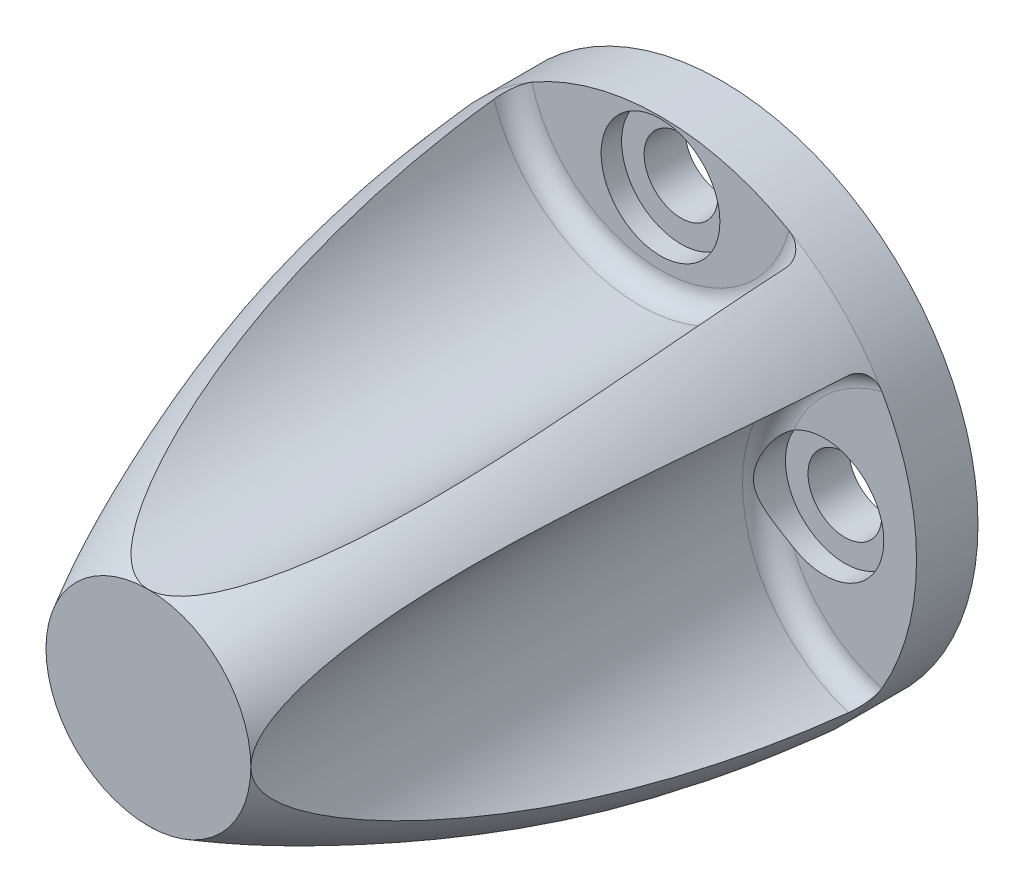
ISO-10303-21;
HEADER;
FILE_DESCRIPTION(('STEP AP214'),'2;1');
FILE_NAME('part.step','',(''),(''),'','','');
FILE_SCHEMA(('AUTOMOTIVE_DESIGN { 1 0 10303 214 1 1 1 1 }'));
ENDSEC;
DATA;
#1=APPLICATION_CONTEXT('core data for automotive mechanical design processes');
#2=APPLICATION_PROTOCOL_DEFINITION('international standard','automotive_design',2000,#1);
#3=PRODUCT_CONTEXT('',#1,'mechanical');
#4=PRODUCT('Part','Part','',(#3));
#5=PRODUCT_RELATED_PRODUCT_CATEGORY('part','',(#4));
#6=PRODUCT_DEFINITION_FORMATION('','',#4);
#7=PRODUCT_DEFINITION_CONTEXT('part definition',#1,'design');
#8=PRODUCT_DEFINITION('design','',#6,#7);
#9=PRODUCT_DEFINITION_SHAPE('','',#8);
#10=(LENGTH_UNIT() NAMED_UNIT(*) SI_UNIT(.MILLI.,.METRE.));
#11=(NAMED_UNIT(*) PLANE_ANGLE_UNIT() SI_UNIT($,.RADIAN.));
#12=(NAMED_UNIT(*) SI_UNIT($,.STERADIAN.) SOLID_ANGLE_UNIT());
#13=UNCERTAINTY_MEASURE_WITH_UNIT(LENGTH_MEASURE(1.E-05),#10,'distance_accuracy_value','');
#14=(GEOMETRIC_REPRESENTATION_CONTEXT(3) GLOBAL_UNCERTAINTY_ASSIGNED_CONTEXT((#13)) GLOBAL_UNIT_ASSIGNED_CONTEXT((#10,
#11,#12)) REPRESENTATION_CONTEXT('',''));
#15=CARTESIAN_POINT('',(0.,0.,0.));
#16=DIRECTION('',(0.,0.,1.));
#17=DIRECTION('',(1.,0.,0.));
#18=AXIS2_PLACEMENT_3D('',#15,#16,#17);
#19=CARTESIAN_POINT('',(-8.,0.,0.));
#20=DIRECTION('',(0.,0.,1.));
#21=DIRECTION('',(1.,0.,0.));
#22=AXIS2_PLACEMENT_3D('',#19,#20,#21);
#23=CYLINDRICAL_SURFACE('',#22,1.8);
#24=CARTESIAN_POINT('',(-8.,0.,0.));
#25=DIRECTION('',(0.,0.,1.));
#26=DIRECTION('',(1.,0.,0.));
#27=AXIS2_PLACEMENT_3D('',#24,#25,#26);
#28=CIRCLE('',#27,1.8);
#29=CARTESIAN_POINT('',(-6.2,0.,0.));
#30=VERTEX_POINT('',#29);
#31=EDGE_CURVE('E321',#30,#30,#28,.T.);
#32=ORIENTED_EDGE('',*,*,#31,.F.);
#33=EDGE_LOOP('',(#32));
#34=FACE_BOUND('',#33,.T.);
#35=CARTESIAN_POINT('',(-8.,0.,2.));
#36=DIRECTION('',(0.,0.,1.));
#37=DIRECTION('',(1.,0.,0.));
#38=AXIS2_PLACEMENT_3D('',#35,#36,#37);
#39=CIRCLE('',#38,1.8);
#40=CARTESIAN_POINT('',(-6.2,0.,2.));
#41=VERTEX_POINT('',#40);
#42=EDGE_CURVE('E558',#41,#41,#39,.F.);
#43=ORIENTED_EDGE('',*,*,#42,.F.);
#44=EDGE_LOOP('',(#43));
#45=FACE_BOUND('',#44,.T.);
#46=ADVANCED_FACE('F39',(#34,#45),#23,.F.);
#47=CARTESIAN_POINT('',(8.,0.,0.));
#48=DIRECTION('',(0.,0.,1.));
#49=DIRECTION('',(1.,0.,0.));
#50=AXIS2_PLACEMENT_3D('',#47,#48,#49);
#51=CYLINDRICAL_SURFACE('',#50,1.8);
#52=CARTESIAN_POINT('',(8.,0.,0.));
#53=DIRECTION('',(0.,0.,1.));
#54=DIRECTION('',(1.,0.,0.));
#55=AXIS2_PLACEMENT_3D('',#52,#53,#54);
#56=CIRCLE('',#55,1.8);
#57=CARTESIAN_POINT('',(9.8,0.,0.));
#58=VERTEX_POINT('',#57);
#59=EDGE_CURVE('E318',#58,#58,#56,.T.);
#60=ORIENTED_EDGE('',*,*,#59,.F.);
#61=EDGE_LOOP('',(#60));
#62=FACE_BOUND('',#61,.T.);
#63=CARTESIAN_POINT('',(8.,0.,2.));
#64=DIRECTION('',(0.,0.,1.));
#65=DIRECTION('',(1.,0.,0.));
#66=AXIS2_PLACEMENT_3D('',#63,#64,#65);
#67=CIRCLE('',#66,1.8);
#68=CARTESIAN_POINT('',(9.8,0.,2.));
#69=VERTEX_POINT('',#68);
#70=EDGE_CURVE('E553',#69,#69,#67,.F.);
#71=ORIENTED_EDGE('',*,*,#70,.F.);
#72=EDGE_LOOP('',(#71));
#73=FACE_BOUND('',#72,.T.);
#74=ADVANCED_FACE('F274',(#62,#73),#51,.F.);
#75=CARTESIAN_POINT('',(0.,-9.5,0.));
#76=DIRECTION('',(0.,0.,1.));
#77=DIRECTION('',(1.,0.,0.));
#78=AXIS2_PLACEMENT_3D('',#75,#76,#77);
#79=CYLINDRICAL_SURFACE('',#78,1.8);
#80=CARTESIAN_POINT('',(0.,-9.5,0.));
#81=DIRECTION('',(0.,0.,1.));
#82=DIRECTION('',(1.,0.,0.));
#83=AXIS2_PLACEMENT_3D('',#80,#81,#82);
#84=CIRCLE('',#83,1.8);
#85=CARTESIAN_POINT('',(1.8,-9.5,0.));
#86=VERTEX_POINT('',#85);
#87=EDGE_CURVE('E314',#86,#86,#84,.T.);
#88=ORIENTED_EDGE('',*,*,#87,.F.);
#89=EDGE_LOOP('',(#88));
#90=FACE_BOUND('',#89,.T.);
#91=CARTESIAN_POINT('',(0.,-9.5,2.));
#92=DIRECTION('',(0.,0.,1.));
#93=DIRECTION('',(1.,0.,0.));
#94=AXIS2_PLACEMENT_3D('',#91,#92,#93);
#95=CIRCLE('',#94,1.8);
#96=CARTESIAN_POINT('',(1.8,-9.5,2.));
#97=VERTEX_POINT('',#96);
#98=EDGE_CURVE('E550',#97,#97,#95,.F.);
#99=ORIENTED_EDGE('',*,*,#98,.F.);
#100=EDGE_LOOP('',(#99));
#101=FACE_BOUND('',#100,.T.);
#102=ADVANCED_FACE('F280',(#90,#101),#79,.F.);
#103=CARTESIAN_POINT('',(0.,9.5,0.));
#104=DIRECTION('',(0.,0.,1.));
#105=DIRECTION('',(1.,0.,0.));
#106=AXIS2_PLACEMENT_3D('',#103,#104,#105);
#107=CYLINDRICAL_SURFACE('',#106,1.8);
#108=CARTESIAN_POINT('',(0.,9.5,0.));
#109=DIRECTION('',(0.,0.,1.));
#110=DIRECTION('',(1.,0.,0.));
#111=AXIS2_PLACEMENT_3D('',#108,#109,#110);
#112=CIRCLE('',#111,1.8);
#113=CARTESIAN_POINT('',(1.8,9.5,0.));
#114=VERTEX_POINT('',#113);
#115=EDGE_CURVE('E310',#114,#114,#112,.T.);
#116=ORIENTED_EDGE('',*,*,#115,.F.);
#117=EDGE_LOOP('',(#116));
#118=FACE_BOUND('',#117,.T.);
#119=CARTESIAN_POINT('',(0.,9.5,2.));
#120=DIRECTION('',(0.,0.,1.));
#121=DIRECTION('',(1.,0.,0.));
#122=AXIS2_PLACEMENT_3D('',#119,#120,#121);
#123=CIRCLE('',#122,1.8);
#124=CARTESIAN_POINT('',(1.8,9.5,2.));
#125=VERTEX_POINT('',#124);
#126=EDGE_CURVE('E498',#125,#125,#123,.F.);
#127=ORIENTED_EDGE('',*,*,#126,.F.);
#128=EDGE_LOOP('',(#127));
#129=FACE_BOUND('',#128,.T.);
#130=ADVANCED_FACE('F196',(#118,#129),#107,.F.);
#131=CARTESIAN_POINT('',(12.5000000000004,3.52975155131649E-13,4.));
#132=DIRECTION('',(0.,0.,1.));
#133=DIRECTION('',(1.,0.,0.));
#134=AXIS2_PLACEMENT_3D('',#131,#132,#133);
#135=TOROIDAL_SURFACE('',#134,6.49999999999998,1.);
#136=CARTESIAN_POINT('',(7.82090945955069,2.89446481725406,4.06294197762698));
#137=CARTESIAN_POINT('',(7.82272973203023,2.89457566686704,4.03935159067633));
#138=CARTESIAN_POINT('',(7.823524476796,2.89462509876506,4.01569343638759));
#139=CARTESIAN_POINT('',(7.82306489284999,2.89459772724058,3.96840159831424));
#140=CARTESIAN_POINT('',(7.82181095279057,2.8945209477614,3.94476791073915));
#141=CARTESIAN_POINT('',(7.8149990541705,2.89409743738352,3.87433185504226));
#142=CARTESIAN_POINT('',(7.80640651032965,2.89355853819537,3.82778959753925));
#143=CARTESIAN_POINT('',(7.78152103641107,2.89178469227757,3.73687221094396));
#144=CARTESIAN_POINT('',(7.76522922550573,2.8905498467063,3.6924967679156));
#145=CARTESIAN_POINT('',(7.72570073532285,2.88706624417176,3.60699287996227));
#146=CARTESIAN_POINT('',(7.70246140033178,2.88481709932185,3.56586568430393));
#147=CARTESIAN_POINT('',(7.64927166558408,2.87884062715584,3.48656316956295));
#148=CARTESIAN_POINT('',(7.61914291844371,2.87507150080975,3.44851132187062));
#149=CARTESIAN_POINT('',(7.55384034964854,2.86566393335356,3.37730100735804));
#150=CARTESIAN_POINT('',(7.51866468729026,2.86002480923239,3.34414433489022));
#151=CARTESIAN_POINT('',(7.43993034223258,2.84571756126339,3.27913223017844));
#152=CARTESIAN_POINT('',(7.39587297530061,2.83676079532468,3.2479465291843));
#153=CARTESIAN_POINT('',(7.30461718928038,2.81578502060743,3.19187213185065));
#154=CARTESIAN_POINT('',(7.25741679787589,2.80376407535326,3.16698743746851));
#155=CARTESIAN_POINT('',(7.13716264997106,2.7696753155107,3.1121009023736));
#156=CARTESIAN_POINT('',(7.06299383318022,2.74559037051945,3.08577232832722));
#157=CARTESIAN_POINT('',(6.91418921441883,2.6902363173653,3.04439303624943));
#158=CARTESIAN_POINT('',(6.83955275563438,2.65895208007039,3.02936635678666));
#159=CARTESIAN_POINT('',(6.66653267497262,2.57757066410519,3.00496427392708));
#160=CARTESIAN_POINT('',(6.56891675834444,2.52471448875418,2.99937127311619));
#161=CARTESIAN_POINT('',(6.38050404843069,2.40823258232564,3.00074058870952));
#162=CARTESIAN_POINT('',(6.28971742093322,2.34459123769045,3.00772125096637));
#163=CARTESIAN_POINT('',(6.08845861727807,2.18571428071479,3.03469864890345));
#164=CARTESIAN_POINT('',(5.98124321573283,2.08694897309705,3.05820226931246));
#165=CARTESIAN_POINT('',(5.78408033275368,1.87632182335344,3.1155480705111));
#166=CARTESIAN_POINT('',(5.69413963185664,1.76445486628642,3.149394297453));
#167=CARTESIAN_POINT('',(5.53083895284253,1.52783570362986,3.22350813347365));
#168=CARTESIAN_POINT('',(5.45782060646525,1.40288160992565,3.26388401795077));
#169=CARTESIAN_POINT('',(5.3628068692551,1.20848731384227,3.32508475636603));
#170=CARTESIAN_POINT('',(5.33351786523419,1.14241245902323,3.34562600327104));
#171=CARTESIAN_POINT('',(5.2798970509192,1.00809937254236,3.38608212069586));
#172=CARTESIAN_POINT('',(5.25556355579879,0.939861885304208,3.40599720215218));
#173=CARTESIAN_POINT('',(5.21372434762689,0.806923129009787,3.44260950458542));
#174=CARTESIAN_POINT('',(5.19582595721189,0.742381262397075,3.45943671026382));
#175=CARTESIAN_POINT('',(5.16443263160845,0.611619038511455,3.49059248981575));
#176=CARTESIAN_POINT('',(5.15093802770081,0.545398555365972,3.50492087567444));
#177=CARTESIAN_POINT('',(5.12861696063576,0.411946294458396,3.52962670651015));
#178=CARTESIAN_POINT('',(5.11975644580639,0.344725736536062,3.54003280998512));
#179=CARTESIAN_POINT('',(5.1067590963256,0.209239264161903,3.55563378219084));
#180=CARTESIAN_POINT('',(5.1026194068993,0.140974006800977,3.56083180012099));
#181=CARTESIAN_POINT('',(5.09917737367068,0.00338632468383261,3.56513588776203));
#182=CARTESIAN_POINT('',(5.09992713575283,-0.0659396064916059,3.5641763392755));
#183=CARTESIAN_POINT('',(5.1063588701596,-0.204019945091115,3.55619395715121));
#184=CARTESIAN_POINT('',(5.11204314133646,-0.272774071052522,3.5491682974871));
#185=CARTESIAN_POINT('',(5.12822585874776,-0.409500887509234,3.53016410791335));
#186=CARTESIAN_POINT('',(5.13875902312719,-0.477464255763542,3.51814992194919));
#187=CARTESIAN_POINT('',(5.16444113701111,-0.611788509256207,3.49066366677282));
#188=CARTESIAN_POINT('',(5.17959128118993,-0.678148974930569,3.4751907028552));
#189=CARTESIAN_POINT('',(5.21843660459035,-0.824569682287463,3.43821009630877));
#190=CARTESIAN_POINT('',(5.24330390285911,-0.904175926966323,3.41613941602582));
#191=CARTESIAN_POINT('',(5.29962232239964,-1.06060034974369,3.37060705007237));
#192=CARTESIAN_POINT('',(5.33107416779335,-1.13741822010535,3.3471452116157));
#193=CARTESIAN_POINT('',(5.40040013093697,-1.28799658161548,3.30019539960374));
#194=CARTESIAN_POINT('',(5.43826716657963,-1.36176033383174,3.27670748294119));
#195=CARTESIAN_POINT('',(5.52032062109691,-1.50601980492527,3.23074133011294));
#196=CARTESIAN_POINT('',(5.56451030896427,-1.57651380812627,3.20826362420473));
#197=CARTESIAN_POINT('',(5.70761806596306,-1.78420393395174,3.14320319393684));
#198=CARTESIAN_POINT('',(5.81631186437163,-1.91593703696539,3.10355165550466));
#199=CARTESIAN_POINT('',(5.99687791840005,-2.0987755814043,3.05611196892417));
#200=CARTESIAN_POINT('',(6.05994791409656,-2.15723341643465,3.04230930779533));
#201=CARTESIAN_POINT('',(6.19156714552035,-2.26869707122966,3.01989317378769));
#202=CARTESIAN_POINT('',(6.26011182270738,-2.32170734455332,3.01127543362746));
#203=CARTESIAN_POINT('',(6.41234896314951,-2.42883366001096,2.99989420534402));
#204=CARTESIAN_POINT('',(6.49679808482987,-2.48199967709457,2.99815832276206));
#205=CARTESIAN_POINT('',(6.67033401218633,-2.57911280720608,3.00608451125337));
#206=CARTESIAN_POINT('',(6.75941361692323,-2.6230737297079,3.01572936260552));
#207=CARTESIAN_POINT('',(6.91904623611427,-2.69208611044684,3.04589707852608));
#208=CARTESIAN_POINT('',(6.98926803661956,-2.71916707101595,3.06349116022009));
#209=CARTESIAN_POINT('',(7.12846888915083,-2.76691402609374,3.10924804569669));
#210=CARTESIAN_POINT('',(7.1974495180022,-2.78758879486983,3.13739627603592));
#211=CARTESIAN_POINT('',(7.31667941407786,-2.81887129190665,3.19846794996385));
#212=CARTESIAN_POINT('',(7.36778518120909,-2.83068573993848,3.22909140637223));
#213=CARTESIAN_POINT('',(7.46517981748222,-2.85068991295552,3.29825915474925));
#214=CARTESIAN_POINT('',(7.51147020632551,-2.85888078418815,3.33680093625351));
#215=CARTESIAN_POINT('',(7.59722451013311,-2.87222514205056,3.42207122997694));
#216=CARTESIAN_POINT('',(7.63662512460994,-2.87735141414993,3.46886844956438));
#217=CARTESIAN_POINT('',(7.70554892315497,-2.88522309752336,3.56947342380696));
#218=CARTESIAN_POINT('',(7.73507834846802,-2.88797001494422,3.62327671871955));
#219=CARTESIAN_POINT('',(7.77858185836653,-2.89160482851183,3.72748325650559));
#220=CARTESIAN_POINT('',(7.79422403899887,-2.89270964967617,3.77718744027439));
#221=CARTESIAN_POINT('',(7.81591949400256,-2.89417309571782,3.87860644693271));
#222=CARTESIAN_POINT('',(7.82199557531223,-2.89453349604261,3.93031618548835));
#223=CARTESIAN_POINT('',(7.82343400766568,-2.89461954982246,3.99554502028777));
#224=CARTESIAN_POINT('',(7.82339530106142,-2.8946174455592,4.00905226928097));
#225=CARTESIAN_POINT('',(7.82265034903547,-2.89457216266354,4.03602674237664));
#226=CARTESIAN_POINT('',(7.82194516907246,-2.89452904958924,4.04949399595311));
#227=CARTESIAN_POINT('',(7.82090945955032,-2.89446481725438,4.06294197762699));
#228=B_SPLINE_CURVE_WITH_KNOTS('',3,(#136,#137,#138,#139,#140,#141,#142,#143,#144,#145,#146,
#147,#148,#149,#150,#151,#152,#153,#154,#155,#156,#157,#158,#159,#160,#161,#162,#163,#164,#165,
#166,#167,#168,#169,#170,#171,#172,#173,#174,#175,#176,#177,#178,#179,#180,#181,#182,#183,#184,
#185,#186,#187,#188,#189,#190,#191,#192,#193,#194,#195,#196,#197,#198,#199,#200,#201,#202,#203,
#204,#205,#206,#207,#208,#209,#210,#211,#212,#213,#214,#215,#216,#217,#218,#219,#220,#221,#222,
#223,#224,#225,#226,#227),.UNSPECIFIED.,.F.,.F.,(4,2,2,2,2,2,2,2,2,2,2,2,2,2,2,2,2,2,2,2,2,2,2,
2,2,2,2,2,2,2,2,2,2,2,2,2,2,2,2,2,2,2,2,2,2,4),(0.,0.0709369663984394,0.141860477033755,
0.283099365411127,0.424317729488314,0.565590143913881,0.71104584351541,0.856554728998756,
1.02008471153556,1.18371829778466,1.4292569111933,1.67531630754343,2.00694276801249,
2.33905348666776,2.77964905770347,3.22041721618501,3.66943041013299,3.89469085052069,
4.11987457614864,4.32687455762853,4.53389010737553,4.739362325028,4.94471022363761,
5.1522500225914,5.35988656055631,5.56903347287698,5.77823454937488,6.0367016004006,
6.29519709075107,6.55340905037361,6.81175499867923,7.33413961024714,7.59504446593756,
7.85573429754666,8.15414770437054,8.45211017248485,8.68316897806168,8.91390989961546,
9.09542309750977,9.2768788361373,9.4599229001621,9.64285101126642,9.79836155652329,
9.95350077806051,9.99401257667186,10.0344597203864),.UNSPECIFIED.);
#229=CARTESIAN_POINT('',(6.4900000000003,2.47586348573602,3.));
#230=VERTEX_POINT('',#229);
#231=CARTESIAN_POINT('',(6.49000000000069,-2.47586348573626,3.));
#232=VERTEX_POINT('',#231);
#233=EDGE_CURVE('E11',#230,#232,#228,.T.);
#234=ORIENTED_EDGE('',*,*,#233,.F.);
#235=CARTESIAN_POINT('',(12.5000000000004,3.52975155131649E-13,3.));
#236=DIRECTION('',(0.,0.,1.));
#237=DIRECTION('',(1.,0.,0.));
#238=AXIS2_PLACEMENT_3D('',#235,#236,#237);
#239=CIRCLE('',#238,6.49999999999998);
#240=CARTESIAN_POINT('',(10.8099999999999,6.27645600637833,3.));
#241=VERTEX_POINT('',#240);
#242=EDGE_CURVE('E353',#241,#230,#239,.T.);
#243=ORIENTED_EDGE('',*,*,#242,.F.);
#244=CARTESIAN_POINT('',(10.1678086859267,7.12817533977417,4.00000000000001));
#245=CARTESIAN_POINT('',(10.1703162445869,7.12899608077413,3.97209659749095));
#246=CARTESIAN_POINT('',(10.1735041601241,7.12880776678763,3.9442396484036));
#247=CARTESIAN_POINT('',(10.1812014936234,7.12643193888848,3.88880143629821));
#248=CARTESIAN_POINT('',(10.1857105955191,7.12424490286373,3.86122010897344));
#249=CARTESIAN_POINT('',(10.2011299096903,7.11473444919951,3.77932033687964));
#250=CARTESIAN_POINT('',(10.2139488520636,7.10446670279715,3.7256635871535));
#251=CARTESIAN_POINT('',(10.2441306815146,7.0764725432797,3.62174813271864));
#252=CARTESIAN_POINT('',(10.2614916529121,7.05874927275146,3.57148800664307));
#253=CARTESIAN_POINT('',(10.3001028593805,7.01641117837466,3.47555709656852));
#254=CARTESIAN_POINT('',(10.3213544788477,6.99179389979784,3.42988795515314));
#255=CARTESIAN_POINT('',(10.3676706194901,6.9355491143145,3.34296935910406));
#256=CARTESIAN_POINT('',(10.3928292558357,6.90373594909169,3.30189038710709));
#257=CARTESIAN_POINT('',(10.4456202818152,6.83440789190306,3.2267135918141));
#258=CARTESIAN_POINT('',(10.473253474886,6.79689114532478,3.19261804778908));
#259=CARTESIAN_POINT('',(10.531207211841,6.71558845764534,3.13104715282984));
#260=CARTESIAN_POINT('',(10.5615900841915,6.67161780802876,3.10387436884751));
#261=CARTESIAN_POINT('',(10.6231124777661,6.57972843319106,3.05861644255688));
#262=CARTESIAN_POINT('',(10.6542515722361,6.53181189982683,3.04052629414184));
#263=CARTESIAN_POINT('',(10.706357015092,6.44914950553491,3.01820941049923));
#264=CARTESIAN_POINT('',(10.7273792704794,6.41511491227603,3.01139633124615));
#265=CARTESIAN_POINT('',(10.7690379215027,6.3462735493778,3.0022925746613));
#266=CARTESIAN_POINT('',(10.7896747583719,6.31146777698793,2.99999636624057));
#267=CARTESIAN_POINT('',(10.8099999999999,6.27645600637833,3.));
#268=B_SPLINE_CURVE_WITH_KNOTS('',3,(#244,#245,#246,#247,#248,#249,#250,#251,#252,#253,#254,
#255,#256,#257,#258,#259,#260,#261,#262,#263,#264,#265,#266,#267),.UNSPECIFIED.,.F.,.F.,(4,2,2,
2,2,2,2,2,2,2,2,4),(0.,0.0840284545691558,0.168036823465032,0.335510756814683,0.502914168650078,
0.670377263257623,0.842788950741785,1.01525682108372,1.19431150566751,1.37326739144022,
1.49476129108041,1.61610632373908),.UNSPECIFIED.);
#269=CARTESIAN_POINT('',(10.1678086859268,7.12817533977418,4.00000000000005));
#270=VERTEX_POINT('',#269);
#271=EDGE_CURVE('E207',#270,#241,#268,.T.);
#272=ORIENTED_EDGE('',*,*,#271,.F.);
#273=CARTESIAN_POINT('',(12.5000000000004,3.52975155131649E-13,4.));
#274=DIRECTION('',(0.,0.,1.));
#275=DIRECTION('',(1.,0.,0.));
#276=AXIS2_PLACEMENT_3D('',#273,#274,#275);
#277=CIRCLE('',#276,7.49999999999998);
#278=CARTESIAN_POINT('',(10.1678086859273,-7.12817533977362,3.99999999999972));
#279=VERTEX_POINT('',#278);
#280=EDGE_CURVE('E357',#279,#270,#277,.F.);
#281=ORIENTED_EDGE('',*,*,#280,.F.);
#282=CARTESIAN_POINT('',(10.8100000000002,-6.27645600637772,3.));
#283=CARTESIAN_POINT('',(10.7796653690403,-6.32873490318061,2.99996433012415));
#284=CARTESIAN_POINT('',(10.7486105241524,-6.3805580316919,3.00510659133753));
#285=CARTESIAN_POINT('',(10.6860340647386,-6.4818906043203,3.02530448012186));
#286=CARTESIAN_POINT('',(10.6545128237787,-6.53140178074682,3.0403525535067));
#287=CARTESIAN_POINT('',(10.5919255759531,-6.62679598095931,3.07992245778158));
#288=CARTESIAN_POINT('',(10.5608596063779,-6.67267870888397,3.10444506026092));
#289=CARTESIAN_POINT('',(10.5001728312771,-6.75959041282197,3.16229575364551));
#290=CARTESIAN_POINT('',(10.4705519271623,-6.80061972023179,3.19562324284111));
#291=CARTESIAN_POINT('',(10.4136494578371,-6.8768377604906,3.27038108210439));
#292=CARTESIAN_POINT('',(10.3863767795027,-6.91200473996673,3.31184042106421));
#293=CARTESIAN_POINT('',(10.3352955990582,-6.9752813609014,3.40173173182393));
#294=CARTESIAN_POINT('',(10.3114877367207,-7.00338969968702,3.4501649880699));
#295=CARTESIAN_POINT('',(10.2688250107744,-7.051046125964,3.55145123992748));
#296=CARTESIAN_POINT('',(10.2498664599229,-7.07078068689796,3.60417285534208));
#297=CARTESIAN_POINT('',(10.2170105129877,-7.10190938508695,3.71347344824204));
#298=CARTESIAN_POINT('',(10.2031056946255,-7.11331577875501,3.77004662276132));
#299=CARTESIAN_POINT('',(10.1865935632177,-7.12378381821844,3.85602022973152));
#300=CARTESIAN_POINT('',(10.1818330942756,-7.12617237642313,3.88465021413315));
#301=CARTESIAN_POINT('',(10.1737420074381,-7.12879224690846,3.94217003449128));
#302=CARTESIAN_POINT('',(10.170409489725,-7.12902643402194,3.97105947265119));
#303=CARTESIAN_POINT('',(10.1678086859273,-7.12817533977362,3.99999999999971));
#304=B_SPLINE_CURVE_WITH_KNOTS('',3,(#282,#283,#284,#285,#286,#287,#288,#289,#290,#291,#292,
#293,#294,#295,#296,#297,#298,#299,#300,#301,#302,#303),.UNSPECIFIED.,.F.,.F.,(4,2,2,2,2,2,2,2,
2,2,4),(0.,0.181057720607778,0.361977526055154,0.542912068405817,0.72383424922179,
0.905413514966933,1.08702626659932,1.26435027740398,1.44141279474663,1.52867559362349,
1.61582193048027),.UNSPECIFIED.);
#305=CARTESIAN_POINT('',(10.8100000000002,-6.27645600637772,3.));
#306=VERTEX_POINT('',#305);
#307=EDGE_CURVE('E201',#306,#279,#304,.T.);
#308=ORIENTED_EDGE('',*,*,#307,.F.);
#309=EDGE_CURVE('E352',#232,#306,#239,.T.);
#310=ORIENTED_EDGE('',*,*,#309,.F.);
#311=EDGE_LOOP('',(#234,#243,#272,#281,#308,#310));
#312=FACE_BOUND('',#311,.T.);
#313=ADVANCED_FACE('F192',(#312),#135,.F.);
#314=CARTESIAN_POINT('',(-12.4999999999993,1.74339709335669E-13,4.));
#315=DIRECTION('',(0.,0.,1.));
#316=DIRECTION('',(1.,0.,0.));
#317=AXIS2_PLACEMENT_3D('',#314,#315,#316);
#318=TOROIDAL_SURFACE('',#317,6.49999999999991,1.);
#319=CARTESIAN_POINT('',(-7.82090945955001,-2.89446481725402,4.06294197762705));
#320=CARTESIAN_POINT('',(-7.82272973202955,-2.894575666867,4.03935159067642));
#321=CARTESIAN_POINT('',(-7.82352447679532,-2.89462509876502,4.01569343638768));
#322=CARTESIAN_POINT('',(-7.82306489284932,-2.89459772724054,3.96840159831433));
#323=CARTESIAN_POINT('',(-7.8218109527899,-2.89452094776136,3.94476791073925));
#324=CARTESIAN_POINT('',(-7.81499905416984,-2.89409743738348,3.87433185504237));
#325=CARTESIAN_POINT('',(-7.806406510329,-2.89355853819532,3.82778959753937));
#326=CARTESIAN_POINT('',(-7.78152103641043,-2.89178469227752,3.73687221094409));
#327=CARTESIAN_POINT('',(-7.7652292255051,-2.89054984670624,3.69249676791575));
#328=CARTESIAN_POINT('',(-7.72570073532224,-2.8870662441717,3.60699287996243));
#329=CARTESIAN_POINT('',(-7.70246140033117,-2.88481709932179,3.56586568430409));
#330=CARTESIAN_POINT('',(-7.64927166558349,-2.87884062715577,3.48656316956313));
#331=CARTESIAN_POINT('',(-7.61914291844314,-2.87507150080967,3.4485113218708));
#332=CARTESIAN_POINT('',(-7.55384034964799,-2.86566393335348,3.37730100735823));
#333=CARTESIAN_POINT('',(-7.51866468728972,-2.86002480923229,3.3441443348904));
#334=CARTESIAN_POINT('',(-7.43993034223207,-2.84571756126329,3.27913223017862));
#335=CARTESIAN_POINT('',(-7.3958729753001,-2.83676079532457,3.24794652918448));
#336=CARTESIAN_POINT('',(-7.30461718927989,-2.8157850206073,3.19187213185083));
#337=CARTESIAN_POINT('',(-7.25741679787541,-2.80376407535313,3.16698743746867));
#338=CARTESIAN_POINT('',(-7.13716264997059,-2.76967531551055,3.11210090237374));
#339=CARTESIAN_POINT('',(-7.06299383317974,-2.74559037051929,3.08577232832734));
#340=CARTESIAN_POINT('',(-6.91418921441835,-2.6902363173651,3.04439303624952));
#341=CARTESIAN_POINT('',(-6.83955275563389,-2.65895208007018,3.02936635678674));
#342=CARTESIAN_POINT('',(-6.66653267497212,-2.57757066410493,3.00496427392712));
#343=CARTESIAN_POINT('',(-6.56891675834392,-2.52471448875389,2.99937127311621));
#344=CARTESIAN_POINT('',(-6.38050404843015,-2.40823258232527,3.0007405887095));
#345=CARTESIAN_POINT('',(-6.28971742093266,-2.34459123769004,3.00772125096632));
#346=CARTESIAN_POINT('',(-6.08845861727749,-2.18571428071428,3.03469864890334));
#347=CARTESIAN_POINT('',(-5.98124321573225,-2.08694897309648,3.05820226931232));
#348=CARTESIAN_POINT('',(-5.78408033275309,-1.87632182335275,3.11554807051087));
#349=CARTESIAN_POINT('',(-5.69413963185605,-1.76445486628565,3.14939429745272));
#350=CARTESIAN_POINT('',(-5.53083895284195,-1.52783570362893,3.22350813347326));
#351=CARTESIAN_POINT('',(-5.45782060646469,-1.40288160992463,3.26388401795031));
#352=CARTESIAN_POINT('',(-5.36280686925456,-1.20848731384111,3.32508475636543));
#353=CARTESIAN_POINT('',(-5.33351786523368,-1.14241245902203,3.34562600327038));
#354=CARTESIAN_POINT('',(-5.27989705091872,-1.00809937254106,3.38608212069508));
#355=CARTESIAN_POINT('',(-5.25556355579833,-0.939861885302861,3.40599720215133));
#356=CARTESIAN_POINT('',(-5.21372434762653,-0.806923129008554,3.44260950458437));
#357=CARTESIAN_POINT('',(-5.19582595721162,-0.74238126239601,3.45943671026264));
#358=CARTESIAN_POINT('',(-5.1644326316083,-0.611619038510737,3.49059248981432));
#359=CARTESIAN_POINT('',(-5.15093802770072,-0.545398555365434,3.50492087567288));
#360=CARTESIAN_POINT('',(-5.12861696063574,-0.411946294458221,3.52962670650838));
#361=CARTESIAN_POINT('',(-5.11975644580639,-0.34472573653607,3.54003280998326));
#362=CARTESIAN_POINT('',(-5.10675909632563,-0.20923926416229,3.55563378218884));
#363=CARTESIAN_POINT('',(-5.10261940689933,-0.140974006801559,3.56083180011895));
#364=CARTESIAN_POINT('',(-5.09917737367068,-0.00338632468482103,3.56513588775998));
#365=CARTESIAN_POINT('',(-5.09992713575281,0.0659396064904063,3.56417633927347));
#366=CARTESIAN_POINT('',(-5.10635887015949,0.204019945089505,3.55619395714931));
#367=CARTESIAN_POINT('',(-5.11204314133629,0.272774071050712,3.54916829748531));
#368=CARTESIAN_POINT('',(-5.12822585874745,0.409500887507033,3.5301641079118));
#369=CARTESIAN_POINT('',(-5.1387590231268,0.47746425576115,3.51814992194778));
#370=CARTESIAN_POINT('',(-5.16444113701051,0.61178850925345,3.4906636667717));
#371=CARTESIAN_POINT('',(-5.17959128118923,0.678148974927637,3.47519070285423));
#372=CARTESIAN_POINT('',(-5.21843660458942,0.824569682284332,3.43821009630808));
#373=CARTESIAN_POINT('',(-5.24330390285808,0.904175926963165,3.41613941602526));
#374=CARTESIAN_POINT('',(-5.29962232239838,1.06060034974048,3.37060705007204));
#375=CARTESIAN_POINT('',(-5.33107416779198,1.13741822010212,3.34714521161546));
#376=CARTESIAN_POINT('',(-5.40040013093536,1.28799658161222,3.30019539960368));
#377=CARTESIAN_POINT('',(-5.43826716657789,1.36176033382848,3.27670748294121));
#378=CARTESIAN_POINT('',(-5.52032062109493,1.50601980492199,3.23074133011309));
#379=CARTESIAN_POINT('',(-5.56451030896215,1.576513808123,3.20826362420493));
#380=CARTESIAN_POINT('',(-5.70761806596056,1.78420393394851,3.14320319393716));
#381=CARTESIAN_POINT('',(-5.81631186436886,1.91593703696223,3.10355165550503));
#382=CARTESIAN_POINT('',(-5.99687791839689,2.09877558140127,3.05611196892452));
#383=CARTESIAN_POINT('',(-6.05994791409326,2.15723341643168,3.04230930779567));
#384=CARTESIAN_POINT('',(-6.19156714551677,2.26869707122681,3.01989317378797));
#385=CARTESIAN_POINT('',(-6.26011182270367,2.32170734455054,3.01127543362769));
#386=CARTESIAN_POINT('',(-6.41234896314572,2.42883366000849,2.9998942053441));
#387=CARTESIAN_POINT('',(-6.49679808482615,2.48199967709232,2.99815832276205));
#388=CARTESIAN_POINT('',(-6.67033401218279,2.57911280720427,3.00608451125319));
#389=CARTESIAN_POINT('',(-6.7594136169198,2.62307372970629,3.01572936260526));
#390=CARTESIAN_POINT('',(-6.91904623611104,2.69208611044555,3.04589707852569));
#391=CARTESIAN_POINT('',(-6.98926803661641,2.71916707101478,3.06349116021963));
#392=CARTESIAN_POINT('',(-7.12846888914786,2.7669140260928,3.10924804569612));
#393=CARTESIAN_POINT('',(-7.19744951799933,2.78758879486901,3.1373962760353));
#394=CARTESIAN_POINT('',(-7.31667941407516,2.818871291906,3.19846794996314));
#395=CARTESIAN_POINT('',(-7.36778518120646,2.83068573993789,3.22909140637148));
#396=CARTESIAN_POINT('',(-7.46517981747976,2.85068991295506,3.29825915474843));
#397=CARTESIAN_POINT('',(-7.51147020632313,2.85888078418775,3.33680093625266));
#398=CARTESIAN_POINT('',(-7.59722451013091,2.87222514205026,3.42207122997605));
#399=CARTESIAN_POINT('',(-7.63662512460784,2.87735141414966,3.46886844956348));
#400=CARTESIAN_POINT('',(-7.70554892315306,2.88522309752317,3.56947342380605));
#401=CARTESIAN_POINT('',(-7.7350783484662,2.88797001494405,3.62327671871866));
#402=CARTESIAN_POINT('',(-7.77858185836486,2.8916048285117,3.72748325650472));
#403=CARTESIAN_POINT('',(-7.79422403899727,2.89270964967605,3.77718744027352));
#404=CARTESIAN_POINT('',(-7.81591949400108,2.89417309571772,3.87860644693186));
#405=CARTESIAN_POINT('',(-7.82199557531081,2.89453349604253,3.93031618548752));
#406=CARTESIAN_POINT('',(-7.82343400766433,2.89461954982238,3.99554502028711));
#407=CARTESIAN_POINT('',(-7.82339530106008,2.89461744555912,4.00905226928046));
#408=CARTESIAN_POINT('',(-7.82265034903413,2.89457216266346,4.03602674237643));
#409=CARTESIAN_POINT('',(-7.82194516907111,2.89452904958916,4.04949399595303));
#410=CARTESIAN_POINT('',(-7.82090945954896,2.8944648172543,4.06294197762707));
#411=B_SPLINE_CURVE_WITH_KNOTS('',3,(#319,#320,#321,#322,#323,#324,#325,#326,#327,#328,#329,
#330,#331,#332,#333,#334,#335,#336,#337,#338,#339,#340,#341,#342,#343,#344,#345,#346,#347,#348,
#349,#350,#351,#352,#353,#354,#355,#356,#357,#358,#359,#360,#361,#362,#363,#364,#365,#366,#367,
#368,#369,#370,#371,#372,#373,#374,#375,#376,#377,#378,#379,#380,#381,#382,#383,#384,#385,#386,
#387,#388,#389,#390,#391,#392,#393,#394,#395,#396,#397,#398,#399,#400,#401,#402,#403,#404,#405,
#406,#407,#408,#409,#410),.UNSPECIFIED.,.F.,.F.,(4,2,2,2,2,2,2,2,2,2,2,2,2,2,2,2,2,2,2,2,2,2,2,
2,2,2,2,2,2,2,2,2,2,2,2,2,2,2,2,2,2,2,2,2,2,4),(0.,0.070936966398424,0.141860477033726,
0.283099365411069,0.424317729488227,0.565590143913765,0.711045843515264,0.856554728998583,
1.02008471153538,1.18371829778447,1.42925691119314,1.6753163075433,2.00694276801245,
2.33905348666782,2.77964905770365,3.22041721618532,3.66943041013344,3.8946908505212,
4.11987457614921,4.32687455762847,4.53389010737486,4.73936232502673,4.94471022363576,
5.15225002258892,5.3598865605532,5.56903347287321,5.77823454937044,6.03670160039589,
6.29519709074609,6.55340905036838,6.81175499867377,7.33413961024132,7.59504446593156,
7.85573429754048,8.15414770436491,8.45211017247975,8.68316897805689,8.91390989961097,
9.09542309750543,9.27687883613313,9.45992290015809,9.64285101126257,9.79836155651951,
9.9535007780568,9.9940125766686,10.0344597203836),.UNSPECIFIED.);
#412=CARTESIAN_POINT('',(-6.48999999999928,-2.4758634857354,3.));
#413=VERTEX_POINT('',#412);
#414=CARTESIAN_POINT('',(-6.48999999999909,2.47586348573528,3.));
#415=VERTEX_POINT('',#414);
#416=EDGE_CURVE('E50',#413,#415,#411,.T.);
#417=ORIENTED_EDGE('',*,*,#416,.F.);
#418=CARTESIAN_POINT('',(-12.4999999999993,1.74339709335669E-13,3.));
#419=DIRECTION('',(0.,0.,1.));
#420=DIRECTION('',(1.,0.,0.));
#421=AXIS2_PLACEMENT_3D('',#418,#419,#420);
#422=CIRCLE('',#421,6.49999999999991);
#423=CARTESIAN_POINT('',(-10.81,-6.27645600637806,3.));
#424=VERTEX_POINT('',#423);
#425=EDGE_CURVE('E142',#424,#413,#422,.T.);
#426=ORIENTED_EDGE('',*,*,#425,.F.);
#427=CARTESIAN_POINT('',(-10.1678086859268,-7.12817533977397,4.00000000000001));
#428=CARTESIAN_POINT('',(-10.170316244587,-7.12899608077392,3.97209659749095));
#429=CARTESIAN_POINT('',(-10.1735041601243,-7.12880776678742,3.9442396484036));
#430=CARTESIAN_POINT('',(-10.1812014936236,-7.12643193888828,3.88880143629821));
#431=CARTESIAN_POINT('',(-10.1857105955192,-7.12424490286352,3.86122010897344));
#432=CARTESIAN_POINT('',(-10.2011299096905,-7.1147344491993,3.77932033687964));
#433=CARTESIAN_POINT('',(-10.2139488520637,-7.10446670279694,3.72566358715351));
#434=CARTESIAN_POINT('',(-10.2441306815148,-7.07647254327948,3.62174813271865));
#435=CARTESIAN_POINT('',(-10.2614916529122,-7.05874927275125,3.57148800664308));
#436=CARTESIAN_POINT('',(-10.3001028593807,-7.01641117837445,3.47555709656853));
#437=CARTESIAN_POINT('',(-10.3213544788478,-6.99179389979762,3.42988795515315));
#438=CARTESIAN_POINT('',(-10.3676706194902,-6.93554911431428,3.34296935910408));
#439=CARTESIAN_POINT('',(-10.3928292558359,-6.90373594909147,3.3018903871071));
#440=CARTESIAN_POINT('',(-10.4456202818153,-6.83440789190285,3.22671359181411));
#441=CARTESIAN_POINT('',(-10.4732534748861,-6.79689114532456,3.1926180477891));
#442=CARTESIAN_POINT('',(-10.5312072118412,-6.71558845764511,3.13104715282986));
#443=CARTESIAN_POINT('',(-10.5615900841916,-6.67161780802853,3.10387436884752));
#444=CARTESIAN_POINT('',(-10.6231124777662,-6.57972843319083,3.05861644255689));
#445=CARTESIAN_POINT('',(-10.6542515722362,-6.5318118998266,3.04052629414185));
#446=CARTESIAN_POINT('',(-10.7063570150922,-6.44914950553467,3.01820941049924));
#447=CARTESIAN_POINT('',(-10.7273792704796,-6.41511491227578,3.01139633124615));
#448=CARTESIAN_POINT('',(-10.7690379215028,-6.34627354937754,3.0022925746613));
#449=CARTESIAN_POINT('',(-10.7896747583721,-6.31146777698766,2.99999636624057));
#450=CARTESIAN_POINT('',(-10.81,-6.27645600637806,3.));
#451=B_SPLINE_CURVE_WITH_KNOTS('',3,(#427,#428,#429,#430,#431,#432,#433,#434,#435,#436,#437,
#438,#439,#440,#441,#442,#443,#444,#445,#446,#447,#448,#449,#450),.UNSPECIFIED.,.F.,.F.,(4,2,2,
2,2,2,2,2,2,2,2,4),(0.,0.0840284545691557,0.16803682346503,0.335510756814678,0.502914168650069,
0.670377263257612,0.842788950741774,1.01525682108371,1.19431150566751,1.37326739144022,
1.49476129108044,1.61610632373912),.UNSPECIFIED.);
#452=CARTESIAN_POINT('',(-10.167808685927,-7.12817533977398,4.00000000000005));
#453=VERTEX_POINT('',#452);
#454=EDGE_CURVE('E135',#453,#424,#451,.T.);
#455=ORIENTED_EDGE('',*,*,#454,.F.);
#456=CARTESIAN_POINT('',(-12.4999999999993,1.74339709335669E-13,4.));
#457=DIRECTION('',(0.,0.,1.));
#458=DIRECTION('',(1.,0.,0.));
#459=AXIS2_PLACEMENT_3D('',#456,#457,#458);
#460=CIRCLE('',#459,7.49999999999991);
#461=CARTESIAN_POINT('',(-10.1678086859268,7.12817533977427,3.99999999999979));
#462=VERTEX_POINT('',#461);
#463=EDGE_CURVE('E155',#462,#453,#460,.F.);
#464=ORIENTED_EDGE('',*,*,#463,.F.);
#465=CARTESIAN_POINT('',(-10.8099999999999,6.27645600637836,3.));
#466=CARTESIAN_POINT('',(-10.7796653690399,6.32873490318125,2.99996433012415));
#467=CARTESIAN_POINT('',(-10.748610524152,6.38055803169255,3.00510659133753));
#468=CARTESIAN_POINT('',(-10.6860340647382,6.48189060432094,3.02530448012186));
#469=CARTESIAN_POINT('',(-10.6545128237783,6.53140178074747,3.0403525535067));
#470=CARTESIAN_POINT('',(-10.5919255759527,6.62679598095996,3.07992245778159));
#471=CARTESIAN_POINT('',(-10.5608596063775,6.67267870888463,3.10444506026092));
#472=CARTESIAN_POINT('',(-10.5001728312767,6.75959041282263,3.16229575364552));
#473=CARTESIAN_POINT('',(-10.4705519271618,6.80061972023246,3.19562324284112));
#474=CARTESIAN_POINT('',(-10.4136494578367,6.87683776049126,3.27038108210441));
#475=CARTESIAN_POINT('',(-10.3863767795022,6.9120047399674,3.31184042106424));
#476=CARTESIAN_POINT('',(-10.3352955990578,6.97528136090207,3.40173173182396));
#477=CARTESIAN_POINT('',(-10.3114877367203,7.00338969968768,3.45016498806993));
#478=CARTESIAN_POINT('',(-10.268825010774,7.05104612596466,3.55145123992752));
#479=CARTESIAN_POINT('',(-10.2498664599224,7.07078068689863,3.60417285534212));
#480=CARTESIAN_POINT('',(-10.2170105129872,7.10190938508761,3.71347344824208));
#481=CARTESIAN_POINT('',(-10.203105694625,7.11331577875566,3.77004662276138));
#482=CARTESIAN_POINT('',(-10.1865935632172,7.12378381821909,3.85602022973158));
#483=CARTESIAN_POINT('',(-10.1818330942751,7.12617237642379,3.88465021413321));
#484=CARTESIAN_POINT('',(-10.1737420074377,7.12879224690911,3.94217003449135));
#485=CARTESIAN_POINT('',(-10.1704094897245,7.12902643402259,3.97105947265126));
#486=CARTESIAN_POINT('',(-10.1678086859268,7.12817533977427,3.99999999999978));
#487=B_SPLINE_CURVE_WITH_KNOTS('',3,(#465,#466,#467,#468,#469,#470,#471,#472,#473,#474,#475,
#476,#477,#478,#479,#480,#481,#482,#483,#484,#485,#486),.UNSPECIFIED.,.F.,.F.,(4,2,2,2,2,2,2,2,
2,2,4),(0.,0.181057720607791,0.361977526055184,0.542912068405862,0.723834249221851,
0.905413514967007,1.08702626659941,1.26435027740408,1.44141279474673,1.5286755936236,
1.61582193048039),.UNSPECIFIED.);
#488=CARTESIAN_POINT('',(-10.8099999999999,6.27645600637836,3.));
#489=VERTEX_POINT('',#488);
#490=EDGE_CURVE('E148',#489,#462,#487,.T.);
#491=ORIENTED_EDGE('',*,*,#490,.F.);
#492=EDGE_CURVE('E140',#415,#489,#422,.T.);
#493=ORIENTED_EDGE('',*,*,#492,.F.);
#494=EDGE_LOOP('',(#417,#426,#455,#464,#491,#493));
#495=FACE_BOUND('',#494,.T.);
#496=ADVANCED_FACE('F41',(#495),#318,.F.);
#497=CARTESIAN_POINT('',(0.,0.,3.));
#498=DIRECTION('',(0.,0.,1.));
#499=DIRECTION('',(1.,0.,0.));
#500=AXIS2_PLACEMENT_3D('',#497,#498,#499);
#501=PLANE('',#500);
#502=CARTESIAN_POINT('',(0.,-9.5,3.));
#503=DIRECTION('',(0.,0.,1.));
#504=DIRECTION('',(1.,0.,0.));
#505=AXIS2_PLACEMENT_3D('',#502,#503,#504);
#506=CIRCLE('',#505,2.9);
#507=CARTESIAN_POINT('',(2.9,-9.5,3.));
#508=VERTEX_POINT('',#507);
#509=EDGE_CURVE('E44',#508,#508,#506,.F.);
#510=ORIENTED_EDGE('',*,*,#509,.T.);
#511=EDGE_LOOP('',(#510));
#512=FACE_BOUND('',#511,.T.);
#513=CARTESIAN_POINT('',(0.,0.,3.));
#514=DIRECTION('',(0.,0.,1.));
#515=DIRECTION('',(1.,0.,0.));
#516=AXIS2_PLACEMENT_3D('',#513,#514,#515);
#517=CIRCLE('',#516,12.5);
#518=CARTESIAN_POINT('',(-6.27645600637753,-10.8100000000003,3.));
#519=VERTEX_POINT('',#518);
#520=CARTESIAN_POINT('',(6.27645600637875,-10.8099999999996,3.));
#521=VERTEX_POINT('',#520);
#522=EDGE_CURVE('E332',#519,#521,#517,.T.);
#523=ORIENTED_EDGE('',*,*,#522,.T.);
#524=CARTESIAN_POINT('',(7.05950310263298E-13,-12.5,3.));
#525=DIRECTION('',(0.,0.,1.));
#526=DIRECTION('',(1.,0.,0.));
#527=AXIS2_PLACEMENT_3D('',#524,#525,#526);
#528=CIRCLE('',#527,6.50000000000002);
#529=EDGE_CURVE('E156',#521,#519,#528,.T.);
#530=ORIENTED_EDGE('',*,*,#529,.T.);
#531=EDGE_LOOP('',(#523,#530));
#532=FACE_BOUND('',#531,.T.);
#533=ADVANCED_FACE('F287',(#512,#532),#501,.T.);
#534=ORIENTED_EDGE('',*,*,#425,.T.);
#535=CARTESIAN_POINT('',(-8.,0.,3.));
#536=DIRECTION('',(0.,0.,1.));
#537=DIRECTION('',(1.,0.,0.));
#538=AXIS2_PLACEMENT_3D('',#535,#536,#537);
#539=CIRCLE('',#538,2.9);
#540=EDGE_CURVE('E63',#413,#415,#539,.F.);
#541=ORIENTED_EDGE('',*,*,#540,.T.);
#542=ORIENTED_EDGE('',*,*,#492,.T.);
#543=EDGE_CURVE('E337',#489,#424,#517,.T.);
#544=ORIENTED_EDGE('',*,*,#543,.T.);
#545=EDGE_LOOP('',(#534,#541,#542,#544));
#546=FACE_BOUND('',#545,.T.);
#547=ADVANCED_FACE('F138',(#546),#501,.T.);
#548=CARTESIAN_POINT('',(0.,9.5,3.));
#549=DIRECTION('',(0.,0.,1.));
#550=DIRECTION('',(1.,0.,0.));
#551=AXIS2_PLACEMENT_3D('',#548,#549,#550);
#552=CIRCLE('',#551,2.9);
#553=CARTESIAN_POINT('',(2.9,9.5,3.));
#554=VERTEX_POINT('',#553);
#555=EDGE_CURVE('E564',#554,#554,#552,.F.);
#556=ORIENTED_EDGE('',*,*,#555,.T.);
#557=EDGE_LOOP('',(#556));
#558=FACE_BOUND('',#557,.T.);
#559=CARTESIAN_POINT('',(6.27645600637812,10.81,3.));
#560=VERTEX_POINT('',#559);
#561=CARTESIAN_POINT('',(-6.27645600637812,10.81,3.));
#562=VERTEX_POINT('',#561);
#563=EDGE_CURVE('E334',#560,#562,#517,.T.);
#564=ORIENTED_EDGE('',*,*,#563,.T.);
#565=CARTESIAN_POINT('',(0.,12.5,3.));
#566=DIRECTION('',(0.,0.,1.));
#567=DIRECTION('',(1.,0.,0.));
#568=AXIS2_PLACEMENT_3D('',#565,#566,#567);
#569=CIRCLE('',#568,6.5);
#570=EDGE_CURVE('E343',#562,#560,#569,.T.);
#571=ORIENTED_EDGE('',*,*,#570,.T.);
#572=EDGE_LOOP('',(#564,#571));
#573=FACE_BOUND('',#572,.T.);
#574=ADVANCED_FACE('F569',(#558,#573),#501,.T.);
#575=ORIENTED_EDGE('',*,*,#242,.T.);
#576=CARTESIAN_POINT('',(8.,0.,3.));
#577=DIRECTION('',(0.,0.,1.));
#578=DIRECTION('',(1.,0.,0.));
#579=AXIS2_PLACEMENT_3D('',#576,#577,#578);
#580=CIRCLE('',#579,2.9);
#581=EDGE_CURVE('E56',#230,#232,#580,.F.);
#582=ORIENTED_EDGE('',*,*,#581,.T.);
#583=ORIENTED_EDGE('',*,*,#309,.T.);
#584=EDGE_CURVE('E327',#306,#241,#517,.T.);
#585=ORIENTED_EDGE('',*,*,#584,.T.);
#586=EDGE_LOOP('',(#575,#582,#583,#585));
#587=FACE_BOUND('',#586,.T.);
#588=ADVANCED_FACE('F290',(#587),#501,.T.);
#589=CARTESIAN_POINT('',(0.,0.,3.));
#590=DIRECTION('',(0.,0.,-1.));
#591=DIRECTION('',(-1.,0.,0.));
#592=AXIS2_PLACEMENT_3D('',#589,#590,#591);
#593=CYLINDRICAL_SURFACE('',#592,12.5);
#594=ORIENTED_EDGE('',*,*,#543,.F.);
#595=CARTESIAN_POINT('',(0.,0.,3.));
#596=DIRECTION('',(0.,0.,1.));
#597=DIRECTION('',(1.,0.,0.));
#598=AXIS2_PLACEMENT_3D('',#595,#596,#597);
#599=CIRCLE('',#598,12.5);
#600=EDGE_CURVE('E480',#562,#489,#599,.T.);
#601=ORIENTED_EDGE('',*,*,#600,.F.);
#602=ORIENTED_EDGE('',*,*,#563,.F.);
#603=EDGE_CURVE('E408',#241,#560,#599,.T.);
#604=ORIENTED_EDGE('',*,*,#603,.F.);
#605=ORIENTED_EDGE('',*,*,#584,.F.);
#606=EDGE_CURVE('E371',#521,#306,#599,.T.);
#607=ORIENTED_EDGE('',*,*,#606,.F.);
#608=ORIENTED_EDGE('',*,*,#522,.F.);
#609=EDGE_CURVE('E368',#424,#519,#599,.T.);
#610=ORIENTED_EDGE('',*,*,#609,.F.);
#611=EDGE_LOOP('',(#594,#601,#602,#604,#605,#607,#608,#610));
#612=FACE_BOUND('',#611,.T.);
#613=CARTESIAN_POINT('',(0.,0.,0.));
#614=DIRECTION('',(0.,0.,1.));
#615=DIRECTION('',(1.,0.,0.));
#616=AXIS2_PLACEMENT_3D('',#613,#614,#615);
#617=CIRCLE('',#616,12.5);
#618=CARTESIAN_POINT('',(12.5,0.,0.));
#619=VERTEX_POINT('',#618);
#620=EDGE_CURVE('E324',#619,#619,#617,.T.);
#621=ORIENTED_EDGE('',*,*,#620,.T.);
#622=EDGE_LOOP('',(#621));
#623=FACE_BOUND('',#622,.T.);
#624=ADVANCED_FACE('F190',(#612,#623),#593,.T.);
#625=CARTESIAN_POINT('',(0.,0.,0.));
#626=DIRECTION('',(0.,0.,1.));
#627=DIRECTION('',(1.,0.,0.));
#628=AXIS2_PLACEMENT_3D('',#625,#626,#627);
#629=PLANE('',#628);
#630=CARTESIAN_POINT('',(0.,0.,0.));
#631=DIRECTION('',(0.,0.,-1.));
#632=DIRECTION('',(-1.,0.,0.));
#633=AXIS2_PLACEMENT_3D('',#630,#631,#632);
#634=CIRCLE('',#633,3.);
#635=CARTESIAN_POINT('',(-3.,0.,0.));
#636=VERTEX_POINT('',#635);
#637=EDGE_CURVE('E306',#636,#636,#634,.T.);
#638=ORIENTED_EDGE('',*,*,#637,.F.);
#639=EDGE_LOOP('',(#638));
#640=FACE_BOUND('',#639,.T.);
#641=ORIENTED_EDGE('',*,*,#115,.T.);
#642=EDGE_LOOP('',(#641));
#643=FACE_BOUND('',#642,.T.);
#644=ORIENTED_EDGE('',*,*,#87,.T.);
#645=EDGE_LOOP('',(#644));
#646=FACE_BOUND('',#645,.T.);
#647=ORIENTED_EDGE('',*,*,#59,.T.);
#648=EDGE_LOOP('',(#647));
#649=FACE_BOUND('',#648,.T.);
#650=ORIENTED_EDGE('',*,*,#31,.T.);
#651=EDGE_LOOP('',(#650));
#652=FACE_BOUND('',#651,.T.);
#653=ORIENTED_EDGE('',*,*,#620,.F.);
#654=EDGE_LOOP('',(#653));
#655=FACE_BOUND('',#654,.T.);
#656=ADVANCED_FACE('F291',(#640,#643,#646,#649,#652,#655),#629,.F.);
#657=CARTESIAN_POINT('',(7.05950310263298E-13,-12.5,28.));
#658=DIRECTION('',(0.,0.,-1.));
#659=DIRECTION('',(-1.,0.,0.));
#660=AXIS2_PLACEMENT_3D('',#657,#658,#659);
#661=CYLINDRICAL_SURFACE('',#660,7.50000000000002);
#662=CARTESIAN_POINT('',(-7.15454401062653,-10.2500000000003,3.));
#663=CARTESIAN_POINT('',(-7.14478448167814,-10.2190174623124,3.41614865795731));
#664=CARTESIAN_POINT('',(-7.13357341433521,-10.1840230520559,3.8319648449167));
#665=CARTESIAN_POINT('',(-7.1078399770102,-10.106184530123,4.66276666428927));
#666=CARTESIAN_POINT('',(-7.09331754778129,-10.0633402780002,5.07775228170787));
#667=CARTESIAN_POINT('',(-7.06055335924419,-9.96997689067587,5.90671552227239));
#668=CARTESIAN_POINT('',(-7.04231157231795,-9.91945769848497,6.32069313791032));
#669=CARTESIAN_POINT('',(-7.00158776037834,-9.8109226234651,7.14806681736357));
#670=CARTESIAN_POINT('',(-6.97909963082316,-9.75289598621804,7.5614611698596));
#671=CARTESIAN_POINT('',(-6.92935150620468,-9.62972144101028,8.38689673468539));
#672=CARTESIAN_POINT('',(-6.90209155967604,-9.56457360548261,8.79893796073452));
#673=CARTESIAN_POINT('',(-6.84219290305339,-9.4275445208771,9.6215002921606));
#674=CARTESIAN_POINT('',(-6.80955423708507,-9.35566332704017,10.0320214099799));
#675=CARTESIAN_POINT('',(-6.72040005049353,-9.16806589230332,11.056413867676));
#676=CARTESIAN_POINT('',(-6.66010933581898,-9.04841383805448,11.6692457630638));
#677=CARTESIAN_POINT('',(-6.52352694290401,-8.79674622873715,12.8906005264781));
#678=CARTESIAN_POINT('',(-6.44723463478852,-8.66473018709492,13.4991232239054));
#679=CARTESIAN_POINT('',(-6.27607347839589,-8.39062188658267,14.7106463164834));
#680=CARTESIAN_POINT('',(-6.18122288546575,-8.24853961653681,15.3136515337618));
#681=CARTESIAN_POINT('',(-5.96999192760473,-7.95669042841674,16.5139626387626));
#682=CARTESIAN_POINT('',(-5.85361408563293,-7.80692441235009,17.1112691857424));
#683=CARTESIAN_POINT('',(-5.60483789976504,-7.51298954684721,18.2585712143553));
#684=CARTESIAN_POINT('',(-5.4740838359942,-7.36914040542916,18.8090039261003));
#685=CARTESIAN_POINT('',(-5.18777601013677,-7.07980539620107,19.9032835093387));
#686=CARTESIAN_POINT('',(-5.0322128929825,-6.93431893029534,20.4471278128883));
#687=CARTESIAN_POINT('',(-4.77679838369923,-6.71685903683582,21.2574949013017));
#688=CARTESIAN_POINT('',(-4.68776292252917,-6.64434302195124,21.5273012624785));
#689=CARTESIAN_POINT('',(-4.5016771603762,-6.50010169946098,22.0643412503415));
#690=CARTESIAN_POINT('',(-4.4046274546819,-6.42837633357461,22.3315750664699));
#691=CARTESIAN_POINT('',(-4.20171490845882,-6.2862310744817,22.8627711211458));
#692=CARTESIAN_POINT('',(-4.09585932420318,-6.21581016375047,23.1267358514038));
#693=CARTESIAN_POINT('',(-3.87412167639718,-6.07673521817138,23.650868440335));
#694=CARTESIAN_POINT('',(-3.75824138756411,-6.00808087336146,23.9110369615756));
#695=CARTESIAN_POINT('',(-3.55476144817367,-5.89527481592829,24.3419026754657));
#696=CARTESIAN_POINT('',(-3.47036124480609,-5.8504760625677,24.5139418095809));
#697=CARTESIAN_POINT('',(-3.29557790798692,-5.76213930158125,24.8553776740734));
#698=CARTESIAN_POINT('',(-3.20519267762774,-5.71860174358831,25.0247734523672));
#699=CARTESIAN_POINT('',(-3.01744216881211,-5.63299851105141,25.3603854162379));
#700=CARTESIAN_POINT('',(-2.92006721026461,-5.59093500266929,25.5265967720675));
#701=CARTESIAN_POINT('',(-2.7180442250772,-5.50900384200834,25.853186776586));
#702=CARTESIAN_POINT('',(-2.61346110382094,-5.46912123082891,26.0136016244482));
#703=CARTESIAN_POINT('',(-2.39476852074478,-5.3916554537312,26.3282207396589));
#704=CARTESIAN_POINT('',(-2.28066964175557,-5.35406981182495,26.4824316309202));
#705=CARTESIAN_POINT('',(-2.10065855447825,-5.29992179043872,26.7069273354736));
#706=CARTESIAN_POINT('',(-2.0392400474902,-5.28225985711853,26.7805559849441));
#707=CARTESIAN_POINT('',(-1.91302398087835,-5.24778475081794,26.9250536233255));
#708=CARTESIAN_POINT('',(-1.84822727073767,-5.23097136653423,26.9959232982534));
#709=CARTESIAN_POINT('',(-1.72820630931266,-5.2016227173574,27.1203071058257));
#710=CARTESIAN_POINT('',(-1.67367569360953,-5.18890680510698,27.1744465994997));
#711=CARTESIAN_POINT('',(-1.56188968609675,-5.16421241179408,27.2800445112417));
#712=CARTESIAN_POINT('',(-1.50463387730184,-5.15223404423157,27.3315025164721));
#713=CARTESIAN_POINT('',(-1.38713566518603,-5.12914954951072,27.4310944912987));
#714=CARTESIAN_POINT('',(-1.32689413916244,-5.11804316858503,27.4792294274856));
#715=CARTESIAN_POINT('',(-1.20318158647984,-5.09687256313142,27.571354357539));
#716=CARTESIAN_POINT('',(-1.13971146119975,-5.08680805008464,27.615345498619));
#717=CARTESIAN_POINT('',(-0.97670639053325,-5.06321404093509,27.7188593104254));
#718=CARTESIAN_POINT('',(-0.874948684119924,-5.05045421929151,27.7752101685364));
#719=CARTESIAN_POINT('',(-0.716595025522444,-5.03412394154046,27.8476290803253));
#720=CARTESIAN_POINT('',(-0.662878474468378,-5.02915007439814,27.8697448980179));
#721=CARTESIAN_POINT('',(-0.553684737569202,-5.02026552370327,27.9093192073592));
#722=CARTESIAN_POINT('',(-0.498208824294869,-5.01635409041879,27.9267809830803));
#723=CARTESIAN_POINT('',(-0.39642710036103,-5.01034503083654,27.9536413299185));
#724=CARTESIAN_POINT('',(-0.350370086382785,-5.00804430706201,27.9639401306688));
#725=CARTESIAN_POINT('',(-0.257558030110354,-5.00427997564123,27.9808020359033));
#726=CARTESIAN_POINT('',(-0.210803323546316,-5.00281597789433,27.9873668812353));
#727=CARTESIAN_POINT('',(-0.116911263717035,-5.00076434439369,27.9965693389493));
#728=CARTESIAN_POINT('',(-0.0697741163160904,-5.00017626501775,27.9992089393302));
#729=CARTESIAN_POINT('',(0.0245584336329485,-4.99989188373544,28.0004852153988));
#730=CARTESIAN_POINT('',(0.0717538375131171,-5.00019560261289,27.9991217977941));
#731=CARTESIAN_POINT('',(0.16578438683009,-5.00168532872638,27.9924379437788));
#732=CARTESIAN_POINT('',(0.212619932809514,-5.00287014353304,27.9871228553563));
#733=CARTESIAN_POINT('',(0.305682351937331,-5.00608710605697,27.9727054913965));
#734=CARTESIAN_POINT('',(0.351908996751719,-5.00811956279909,27.9636018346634));
#735=CARTESIAN_POINT('',(0.489294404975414,-5.01541685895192,27.9309576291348));
#736=CARTESIAN_POINT('',(0.579145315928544,-5.02188139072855,27.9020849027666));
#737=CARTESIAN_POINT('',(0.798245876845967,-5.04142538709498,27.8151639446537));
#738=CARTESIAN_POINT('',(0.924378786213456,-5.05619691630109,27.7497454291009));
#739=CARTESIAN_POINT('',(1.10468738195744,-5.08155157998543,27.6383734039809));
#740=CARTESIAN_POINT('',(1.16340779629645,-5.09055546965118,27.5989576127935));
#741=CARTESIAN_POINT('',(1.27807723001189,-5.10947321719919,27.5164723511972));
#742=CARTESIAN_POINT('',(1.33402670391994,-5.11938692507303,27.4734034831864));
#743=CARTESIAN_POINT('',(1.49638773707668,-5.14997491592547,27.3410706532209));
#744=CARTESIAN_POINT('',(1.59909470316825,-5.17175769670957,27.2475273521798));
#745=CARTESIAN_POINT('',(1.79617891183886,-5.21755727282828,27.0525179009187));
#746=CARTESIAN_POINT('',(1.89054734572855,-5.24157637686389,26.9510435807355));
#747=CARTESIAN_POINT('',(2.0725163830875,-5.29142234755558,26.7421862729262));
#748=CARTESIAN_POINT('',(2.16009884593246,-5.31725373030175,26.6347886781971));
#749=CARTESIAN_POINT('',(2.3292971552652,-5.37032776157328,26.4158460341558));
#750=CARTESIAN_POINT('',(2.41091570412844,-5.39756976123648,26.3043028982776));
#751=CARTESIAN_POINT('',(2.57832960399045,-5.45649346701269,26.0647910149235));
#752=CARTESIAN_POINT('',(2.66350115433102,-5.48832232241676,25.9364242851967));
#753=CARTESIAN_POINT('',(2.82847472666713,-5.55323217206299,25.6765784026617));
#754=CARTESIAN_POINT('',(2.90827570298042,-5.58631340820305,25.5450986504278));
#755=CARTESIAN_POINT('',(3.06331506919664,-5.65359561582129,25.2794646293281));
#756=CARTESIAN_POINT('',(3.13854579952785,-5.68779832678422,25.1453063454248));
#757=CARTESIAN_POINT('',(3.28484410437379,-5.75712652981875,24.8749679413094));
#758=CARTESIAN_POINT('',(3.35591131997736,-5.79225210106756,24.738787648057));
#759=CARTESIAN_POINT('',(3.56362655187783,-5.89887410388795,24.327534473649));
#760=CARTESIAN_POINT('',(3.69468002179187,-5.97156796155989,24.0499378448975));
#761=CARTESIAN_POINT('',(3.94476371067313,-6.11956301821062,23.4888922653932));
#762=CARTESIAN_POINT('',(4.06375013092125,-6.19487247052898,23.2054261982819));
#763=CARTESIAN_POINT('',(4.29073045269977,-6.34709180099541,22.6349616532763));
#764=CARTESIAN_POINT('',(4.39873670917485,-6.42399976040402,22.3479675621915));
#765=CARTESIAN_POINT('',(4.60509761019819,-6.57887693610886,21.7709244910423));
#766=CARTESIAN_POINT('',(4.70345480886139,-6.65684586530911,21.4808763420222));
#767=CARTESIAN_POINT('',(4.93455956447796,-6.84916267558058,20.7646663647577));
#768=CARTESIAN_POINT('',(5.06242486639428,-6.96381626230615,20.3370090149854));
#769=CARTESIAN_POINT('',(5.30198718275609,-7.19280037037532,19.4769134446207));
#770=CARTESIAN_POINT('',(5.41367656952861,-7.30713071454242,19.0444730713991));
#771=CARTESIAN_POINT('',(5.62257275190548,-7.53407009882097,18.1755987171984));
#772=CARTESIAN_POINT('',(5.71977730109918,-7.64667886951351,17.739164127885));
#773=CARTESIAN_POINT('',(5.90090239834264,-7.8686069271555,16.8640734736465));
#774=CARTESIAN_POINT('',(5.98485913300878,-7.97793449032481,16.4254269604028));
#775=CARTESIAN_POINT('',(6.14108767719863,-8.19248941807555,15.5451620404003));
#776=CARTESIAN_POINT('',(6.21336177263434,-8.29771758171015,15.1035442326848));
#777=CARTESIAN_POINT('',(6.34741722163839,-8.50308544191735,14.217563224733));
#778=CARTESIAN_POINT('',(6.40919886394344,-8.60322527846,13.7732001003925));
#779=CARTESIAN_POINT('',(6.53850687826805,-8.82328043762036,12.7637581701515));
#780=CARTESIAN_POINT('',(6.60321030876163,-8.94139570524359,12.1979235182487));
#781=CARTESIAN_POINT('',(6.71962590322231,-9.16643226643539,11.0626494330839));
#782=CARTESIAN_POINT('',(6.7713366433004,-9.27335233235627,10.4932096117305));
#783=CARTESIAN_POINT('',(6.86363355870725,-9.47464098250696,9.35116693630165));
#784=CARTESIAN_POINT('',(6.90421873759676,-9.56900844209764,8.77856380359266));
#785=CARTESIAN_POINT('',(6.97601309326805,-9.74423814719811,7.62961175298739));
#786=CARTESIAN_POINT('',(7.00720456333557,-9.82507476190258,7.05325782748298));
#787=CARTESIAN_POINT('',(7.06159840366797,-9.97215837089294,5.89835424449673));
#788=CARTESIAN_POINT('',(7.08480140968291,-10.0384065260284,5.31980476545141));
#789=CARTESIAN_POINT('',(7.11455276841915,-10.1263768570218,4.4507225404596));
#790=CARTESIAN_POINT('',(7.12362720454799,-10.1537983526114,4.16084061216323));
#791=CARTESIAN_POINT('',(7.14022041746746,-10.2047955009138,3.58069436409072));
#792=CARTESIAN_POINT('',(7.14773919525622,-10.2283711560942,3.29043004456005));
#793=CARTESIAN_POINT('',(7.1545440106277,-10.2499999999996,3.));
#794=B_SPLINE_CURVE_WITH_KNOTS('',3,(#662,#663,#664,#665,#666,#667,#668,#669,#670,#671,#672,
#673,#674,#675,#676,#677,#678,#679,#680,#681,#682,#683,#684,#685,#686,#687,#688,#689,#690,#691,
#692,#693,#694,#695,#696,#697,#698,#699,#700,#701,#702,#703,#704,#705,#706,#707,#708,#709,#710,
#711,#712,#713,#714,#715,#716,#717,#718,#719,#720,#721,#722,#723,#724,#725,#726,#727,#728,#729,
#730,#731,#732,#733,#734,#735,#736,#737,#738,#739,#740,#741,#742,#743,#744,#745,#746,#747,#748,
#749,#750,#751,#752,#753,#754,#755,#756,#757,#758,#759,#760,#761,#762,#763,#764,#765,#766,#767,
#768,#769,#770,#771,#772,#773,#774,#775,#776,#777,#778,#779,#780,#781,#782,#783,#784,#785,#786,
#787,#788,#789,#790,#791,#792,#793),.UNSPECIFIED.,.F.,.F.,(4,2,2,2,2,2,2,2,2,2,2,2,2,2,2,2,2,2,
2,2,2,2,2,2,2,2,2,2,2,2,2,2,2,2,2,2,2,2,2,2,2,2,2,2,2,2,2,2,2,2,2,2,2,2,2,2,2,2,2,2,2,2,2,2,2,
4),(0.,1.25222208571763,2.50446657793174,3.75672036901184,5.01078829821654,6.26484347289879,
7.51888836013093,9.40046541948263,11.282116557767,13.1619259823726,15.0415152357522,
16.7923054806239,18.5437574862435,19.4233378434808,20.3028529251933,21.1816503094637,
22.0602924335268,22.6505811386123,23.241077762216,23.8324085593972,24.4189759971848,
25.0048995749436,25.2973083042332,25.589643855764,25.8232226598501,26.0568373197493,
26.2903837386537,26.5238653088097,26.873592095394,27.0483267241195,27.2229377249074,
27.3645429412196,27.5060820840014,27.6475495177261,27.7890202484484,27.9302998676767,
28.0716310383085,28.3543330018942,28.7803419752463,28.9941310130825,29.2078848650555,
29.6290165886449,30.0505879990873,30.4732500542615,30.8957193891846,31.3674817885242,
31.8393357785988,32.3119599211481,32.7846247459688,33.730621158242,34.6799367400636,
35.6281720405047,36.5761556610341,37.9583368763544,39.3411677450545,40.7242128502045,
42.1034121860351,43.4823413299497,44.8612325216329,46.6058707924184,48.3507001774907,
50.0956857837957,51.843940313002,53.5920556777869,54.4659821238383,55.3399080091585),.UNSPECIFIED.);
#795=CARTESIAN_POINT('',(-7.12817533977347,-10.1678086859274,3.99999999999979));
#796=VERTEX_POINT('',#795);
#797=CARTESIAN_POINT('',(2.82380124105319E-13,-5.,28.));
#798=VERTEX_POINT('',#797);
#799=EDGE_CURVE('E395',#796,#798,#794,.T.);
#800=ORIENTED_EDGE('',*,*,#799,.F.);
#801=CARTESIAN_POINT('',(7.05950310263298E-13,-12.5,4.));
#802=DIRECTION('',(0.,0.,1.));
#803=DIRECTION('',(1.,0.,0.));
#804=AXIS2_PLACEMENT_3D('',#801,#802,#803);
#805=CIRCLE('',#804,7.50000000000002);
#806=CARTESIAN_POINT('',(7.1281753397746,-10.1678086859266,4.00000000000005));
#807=VERTEX_POINT('',#806);
#808=EDGE_CURVE('E151',#796,#807,#805,.F.);
#809=ORIENTED_EDGE('',*,*,#808,.T.);
#810=EDGE_CURVE('E432',#798,#807,#794,.T.);
#811=ORIENTED_EDGE('',*,*,#810,.F.);
#812=EDGE_LOOP('',(#800,#809,#811));
#813=FACE_BOUND('',#812,.T.);
#814=ADVANCED_FACE('F293',(#813),#661,.F.);
#815=CARTESIAN_POINT('',(12.5000000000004,3.52975155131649E-13,28.));
#816=DIRECTION('',(0.,0.,-1.));
#817=DIRECTION('',(-1.,0.,0.));
#818=AXIS2_PLACEMENT_3D('',#815,#816,#817);
#819=CYLINDRICAL_SURFACE('',#818,7.49999999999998);
#820=CARTESIAN_POINT('',(10.2500000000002,-7.15454401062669,3.));
#821=CARTESIAN_POINT('',(10.2189708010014,-7.14476971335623,3.41677607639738));
#822=CARTESIAN_POINT('',(10.1839175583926,-7.13353956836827,3.83321866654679));
#823=CARTESIAN_POINT('',(10.1059380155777,-7.10775740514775,4.66526968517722));
#824=CARTESIAN_POINT('',(10.0630115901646,-7.09320533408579,5.08087810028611));
#825=CARTESIAN_POINT('',(9.96946141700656,-7.06036932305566,5.911082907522));
#826=CARTESIAN_POINT('',(9.91883762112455,-7.04208535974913,6.3256792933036));
#827=CARTESIAN_POINT('',(9.81023564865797,-7.00132346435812,7.15304136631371));
#828=CARTESIAN_POINT('',(9.75226906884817,-6.97885211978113,7.56580890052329));
#829=CARTESIAN_POINT('',(9.62923709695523,-6.92915014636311,8.38999463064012));
#830=CARTESIAN_POINT('',(9.56417177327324,-6.90191956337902,8.80141283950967));
#831=CARTESIAN_POINT('',(9.42732848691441,-6.84209480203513,9.62273405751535));
#832=CARTESIAN_POINT('',(9.35555056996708,-6.80950066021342,10.0326370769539));
#833=CARTESIAN_POINT('',(9.16822855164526,-6.72047733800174,11.0555257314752));
#834=CARTESIAN_POINT('',(9.04875967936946,-6.66028350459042,11.6674747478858));
#835=CARTESIAN_POINT('',(8.79749171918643,-6.52394498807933,12.8870748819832));
#836=CARTESIAN_POINT('',(8.66569220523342,-6.44779975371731,13.4947258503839));
#837=CARTESIAN_POINT('',(8.39164506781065,-6.27674773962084,14.7062683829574));
#838=CARTESIAN_POINT('',(8.24937796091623,-6.18180538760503,15.3101505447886));
#839=CARTESIAN_POINT('',(7.9571260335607,-5.97033137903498,16.5122239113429));
#840=CARTESIAN_POINT('',(7.8071419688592,-5.85380183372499,17.1104156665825));
#841=CARTESIAN_POINT('',(7.5598754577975,-5.64451824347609,18.0755663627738));
#842=CARTESIAN_POINT('',(7.46407223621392,-5.55939558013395,18.4445681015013));
#843=CARTESIAN_POINT('',(7.27135764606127,-5.3785475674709,19.1797184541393));
#844=CARTESIAN_POINT('',(7.17444619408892,-5.28282141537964,19.5458668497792));
#845=CARTESIAN_POINT('',(6.98032403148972,-5.07965855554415,20.274990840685));
#846=CARTESIAN_POINT('',(6.8831132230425,-4.97221750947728,20.6379652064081));
#847=CARTESIAN_POINT('',(6.68968700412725,-4.74473188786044,21.3587324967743));
#848=CARTESIAN_POINT('',(6.5934692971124,-4.62473288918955,21.7165391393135));
#849=CARTESIAN_POINT('',(6.40270636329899,-4.370165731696,22.4273202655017));
#850=CARTESIAN_POINT('',(6.30816067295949,-4.23560168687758,22.7802960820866));
#851=CARTESIAN_POINT('',(6.16847280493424,-4.02107085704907,23.3049970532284));
#852=CARTESIAN_POINT('',(6.12227791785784,-3.94746881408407,23.4790555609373));
#853=CARTESIAN_POINT('',(6.03075051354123,-3.79561335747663,23.8253561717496));
#854=CARTESIAN_POINT('',(5.98541793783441,-3.71736026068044,23.9975983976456));
#855=CARTESIAN_POINT('',(5.90495710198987,-3.57222769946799,24.3049211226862));
#856=CARTESIAN_POINT('',(5.86963774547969,-3.50629456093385,24.4403985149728));
#857=CARTESIAN_POINT('',(5.79975896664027,-3.37084263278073,24.7097539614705));
#858=CARTESIAN_POINT('',(5.76519955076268,-3.30132381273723,24.8436320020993));
#859=CARTESIAN_POINT('',(5.6968729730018,-3.15812815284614,25.1098087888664));
#860=CARTESIAN_POINT('',(5.66310799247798,-3.08444141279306,25.2421027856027));
#861=CARTESIAN_POINT('',(5.59660097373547,-2.93256800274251,25.5043395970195));
#862=CARTESIAN_POINT('',(5.56385886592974,-2.8543816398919,25.6342825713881));
#863=CARTESIAN_POINT('',(5.49722017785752,-2.6869651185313,25.9006160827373));
#864=CARTESIAN_POINT('',(5.46341348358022,-2.59734538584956,26.0367859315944));
#865=CARTESIAN_POINT('',(5.3974301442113,-2.41107323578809,26.3047645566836));
#866=CARTESIAN_POINT('',(5.36525430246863,-2.31441740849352,26.4365711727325));
#867=CARTESIAN_POINT('',(5.30302653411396,-2.11297751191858,26.6937568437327));
#868=CARTESIAN_POINT('',(5.27296816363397,-2.0082203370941,26.8191550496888));
#869=CARTESIAN_POINT('',(5.22985662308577,-1.84342567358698,27.0006617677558));
#870=CARTESIAN_POINT('',(5.21582086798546,-1.78724257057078,27.0600422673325));
#871=CARTESIAN_POINT('',(5.18850949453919,-1.67200992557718,27.1761261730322));
#872=CARTESIAN_POINT('',(5.17523368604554,-1.61296110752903,27.2328302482));
#873=CARTESIAN_POINT('',(5.15208838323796,-1.50355472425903,27.3321451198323));
#874=CARTESIAN_POINT('',(5.14206133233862,-1.45376271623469,27.3753395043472));
#875=CARTESIAN_POINT('',(5.12267418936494,-1.35194232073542,27.4591571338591));
#876=CARTESIAN_POINT('',(5.11331412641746,-1.29991383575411,27.4997802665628));
#877=CARTESIAN_POINT('',(5.08639313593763,-1.14022313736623,27.6170287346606));
#878=CARTESIAN_POINT('',(5.06997531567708,-1.02888162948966,27.689102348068));
#879=CARTESIAN_POINT('',(5.04396227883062,-0.816548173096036,27.8039230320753));
#880=CARTESIAN_POINT('',(5.03367170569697,-0.717275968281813,27.8496108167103));
#881=CARTESIAN_POINT('',(5.02104571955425,-0.563804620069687,27.9058410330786));
#882=CARTESIAN_POINT('',(5.01730811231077,-0.511950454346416,27.9225218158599));
#883=CARTESIAN_POINT('',(5.01086361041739,-0.406939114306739,27.9513194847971));
#884=CARTESIAN_POINT('',(5.00815614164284,-0.353782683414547,27.963438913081));
#885=CARTESIAN_POINT('',(5.00402948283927,-0.250732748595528,27.981924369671));
#886=CARTESIAN_POINT('',(5.00252588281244,-0.200910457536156,27.9886671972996));
#887=CARTESIAN_POINT('',(5.00050735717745,-0.100731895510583,27.9977230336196));
#888=CARTESIAN_POINT('',(4.99999471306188,-0.0503746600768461,28.0000258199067));
#889=CARTESIAN_POINT('',(4.99999999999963,2.75335310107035E-13,28.));
#890=B_SPLINE_CURVE_WITH_KNOTS('',3,(#820,#821,#822,#823,#824,#825,#826,#827,#828,#829,#830,
#831,#832,#833,#834,#835,#836,#837,#838,#839,#840,#841,#842,#843,#844,#845,#846,#847,#848,#849,
#850,#851,#852,#853,#854,#855,#856,#857,#858,#859,#860,#861,#862,#863,#864,#865,#866,#867,#868,
#869,#870,#871,#872,#873,#874,#875,#876,#877,#878,#879,#880,#881,#882,#883,#884,#885,#886,#887,
#888,#889),.UNSPECIFIED.,.F.,.F.,(4,2,2,2,2,2,2,2,2,2,2,2,2,2,2,2,2,2,2,2,2,2,2,2,2,2,2,2,2,2,2,
2,2,2,4),(0.,1.25410994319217,2.50823983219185,3.76237756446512,5.0145587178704,
6.26672780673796,7.51888836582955,9.39774718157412,11.2766709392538,13.1591850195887,
15.0415150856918,16.2132525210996,17.3850787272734,18.5573403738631,19.7254860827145,
20.8933026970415,21.476884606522,22.0604268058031,22.524643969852,22.988865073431,
23.4542393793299,23.9195819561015,24.4188534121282,24.9183684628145,25.4162911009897,
25.6650457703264,25.9137379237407,26.113675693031,26.313622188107,26.7132089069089,
27.0412043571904,27.2048188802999,27.3683420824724,27.5190354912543,27.6700754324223),.UNSPECIFIED.);
#891=CARTESIAN_POINT('',(5.,1.41190062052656E-13,28.));
#892=VERTEX_POINT('',#891);
#893=EDGE_CURVE('E440',#279,#892,#890,.T.);
#894=ORIENTED_EDGE('',*,*,#893,.F.);
#895=ORIENTED_EDGE('',*,*,#280,.T.);
#896=CARTESIAN_POINT('',(5.,1.41190062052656E-13,28.));
#897=CARTESIAN_POINT('',(4.99999146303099,0.056732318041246,28.0000416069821));
#898=CARTESIAN_POINT('',(5.00064336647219,0.113437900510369,27.9971126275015));
#899=CARTESIAN_POINT('',(5.00320080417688,0.22613609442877,27.985640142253));
#900=CARTESIAN_POINT('',(5.00510375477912,0.28212993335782,27.9771082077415));
#901=CARTESIAN_POINT('',(5.01005355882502,0.392028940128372,27.9549464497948));
#902=CARTESIAN_POINT('',(5.01308015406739,0.445953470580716,27.9414069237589));
#903=CARTESIAN_POINT('',(5.02017863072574,0.552373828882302,27.9097113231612));
#904=CARTESIAN_POINT('',(5.02425108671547,0.604868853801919,27.8915527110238));
#905=CARTESIAN_POINT('',(5.03465236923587,0.723236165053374,27.8452793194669));
#906=CARTESIAN_POINT('',(5.04129289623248,0.788549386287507,27.8158052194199));
#907=CARTESIAN_POINT('',(5.05588975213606,0.916160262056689,27.7512414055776));
#908=CARTESIAN_POINT('',(5.06384651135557,0.978456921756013,27.7161498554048));
#909=CARTESIAN_POINT('',(5.08948550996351,1.16171866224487,27.6035122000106));
#910=CARTESIAN_POINT('',(5.10885216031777,1.27816133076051,27.5189807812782));
#911=CARTESIAN_POINT('',(5.15009240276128,1.49695946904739,27.3405616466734));
#912=CARTESIAN_POINT('',(5.17187462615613,1.59963028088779,27.2470257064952));
#913=CARTESIAN_POINT('',(5.21768317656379,1.79668813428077,27.0519856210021));
#914=CARTESIAN_POINT('',(5.24171176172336,1.89106665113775,26.9504734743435));
#915=CARTESIAN_POINT('',(5.29153606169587,2.07290628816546,26.7417126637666));
#916=CARTESIAN_POINT('',(5.31733366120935,2.16035980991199,26.6344579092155));
#917=CARTESIAN_POINT('',(5.37033711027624,2.32932080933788,26.4158085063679));
#918=CARTESIAN_POINT('',(5.39754232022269,2.41083094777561,26.3044157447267));
#919=CARTESIAN_POINT('',(5.45641961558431,2.57812735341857,26.0650897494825));
#920=CARTESIAN_POINT('',(5.48824011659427,2.66328424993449,25.936755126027));
#921=CARTESIAN_POINT('',(5.5531329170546,2.82823040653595,25.6769739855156));
#922=CARTESIAN_POINT('',(5.58620545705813,2.9080186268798,25.5455268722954));
#923=CARTESIAN_POINT('',(5.65346994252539,3.06303378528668,25.2799587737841));
#924=CARTESIAN_POINT('',(5.68766362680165,3.13825306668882,25.1458337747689));
#925=CARTESIAN_POINT('',(5.75697354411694,3.28452970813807,24.875562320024));
#926=CARTESIAN_POINT('',(5.79208985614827,3.35558671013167,24.7394156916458));
#927=CARTESIAN_POINT('',(5.89868380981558,3.56327290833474,24.3282639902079));
#928=CARTESIAN_POINT('',(5.97135861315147,3.69430916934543,24.0507356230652));
#929=CARTESIAN_POINT('',(6.11934527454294,3.94441283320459,23.4897135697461));
#930=CARTESIAN_POINT('',(6.19466634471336,4.06343135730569,23.2062007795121));
#931=CARTESIAN_POINT('',(6.34691004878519,4.29047080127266,22.6356407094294));
#932=CARTESIAN_POINT('',(6.42383076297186,4.3985040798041,22.3485978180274));
#933=CARTESIAN_POINT('',(6.57873422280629,4.60491488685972,21.771455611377));
#934=CARTESIAN_POINT('',(6.65671668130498,4.70329496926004,21.4813571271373));
#935=CARTESIAN_POINT('',(6.84904706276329,4.93442734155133,20.7650973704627));
#936=CARTESIAN_POINT('',(6.96370073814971,5.06229867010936,20.3374409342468));
#937=CARTESIAN_POINT('',(7.19268548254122,5.3018723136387,19.4773469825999));
#938=CARTESIAN_POINT('',(7.30701637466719,5.41356700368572,19.0449073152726));
#939=CARTESIAN_POINT('',(7.53395727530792,5.62247321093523,18.1760342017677));
#940=CARTESIAN_POINT('',(7.64656701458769,5.71968248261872,17.7396001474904));
#941=CARTESIAN_POINT('',(7.86848640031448,5.90080754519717,16.8645537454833));
#942=CARTESIAN_POINT('',(7.97780461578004,5.98476080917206,16.4259512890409));
#943=CARTESIAN_POINT('',(8.19234210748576,6.14098416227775,15.5457749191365));
#944=CARTESIAN_POINT('',(8.29756218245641,6.21325653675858,15.1042016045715));
#945=CARTESIAN_POINT('',(8.50291536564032,6.34730999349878,14.218309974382));
#946=CARTESIAN_POINT('',(8.60304861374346,6.40909136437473,13.7739917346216));
#947=CARTESIAN_POINT('',(8.82310866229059,6.53841060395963,12.7645698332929));
#948=CARTESIAN_POINT('',(8.94123452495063,6.60312369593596,12.1987098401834));
#949=CARTESIAN_POINT('',(9.16629186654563,6.71955649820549,11.0633845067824));
#950=CARTESIAN_POINT('',(9.27322211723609,6.77127478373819,10.4939187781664));
#951=CARTESIAN_POINT('',(9.47453042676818,6.86358501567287,9.35182378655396));
#952=CARTESIAN_POINT('',(9.56890736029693,6.90417596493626,8.77919424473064));
#953=CARTESIAN_POINT('',(9.74416108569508,6.97598287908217,7.63014939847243));
#954=CARTESIAN_POINT('',(9.82501130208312,7.0071804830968,7.05372890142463));
#955=CARTESIAN_POINT('',(9.97211887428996,7.0615844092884,5.89869156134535));
#956=CARTESIAN_POINT('',(10.0383773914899,7.08479136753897,5.32007489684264));
#957=CARTESIAN_POINT('',(10.1263606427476,7.11454737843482,4.45089157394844));
#958=CARTESIAN_POINT('',(10.1537860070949,7.12362315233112,4.16097590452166));
#959=CARTESIAN_POINT('',(10.2047900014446,7.14021866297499,3.58076207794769));
#960=CARTESIAN_POINT('',(10.2283686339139,7.1477384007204,3.2904639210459));
#961=CARTESIAN_POINT('',(10.2499999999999,7.15454401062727,3.));
#962=B_SPLINE_CURVE_WITH_KNOTS('',3,(#896,#897,#898,#899,#900,#901,#902,#903,#904,#905,#906,
#907,#908,#909,#910,#911,#912,#913,#914,#915,#916,#917,#918,#919,#920,#921,#922,#923,#924,#925,
#926,#927,#928,#929,#930,#931,#932,#933,#934,#935,#936,#937,#938,#939,#940,#941,#942,#943,#944,
#945,#946,#947,#948,#949,#950,#951,#952,#953,#954,#955,#956,#957,#958,#959,#960,#961),
.UNSPECIFIED.,.F.,.F.,(4,2,2,2,2,2,2,2,2,2,2,2,2,2,2,2,2,2,2,2,2,2,2,2,2,2,2,2,2,2,2,2,4),(0.,
0.170075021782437,0.339799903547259,0.50660269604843,0.673497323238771,0.889021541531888,
1.10461636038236,1.53869367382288,1.95989914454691,2.38153267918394,2.80362261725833,
3.22552241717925,3.69717837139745,4.16892540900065,4.64144235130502,5.1139998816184,
6.05978163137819,7.00926700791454,7.95767208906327,8.90582557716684,10.288009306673,
11.670842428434,13.0538896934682,14.4329544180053,15.8117490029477,17.1905056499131,
18.9352274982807,20.6801405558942,22.4252099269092,24.1736685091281,25.9219878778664,
26.7960162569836,27.6700440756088),.UNSPECIFIED.);
#963=EDGE_CURVE('E453',#892,#270,#962,.T.);
#964=ORIENTED_EDGE('',*,*,#963,.F.);
#965=EDGE_LOOP('',(#894,#895,#964));
#966=FACE_BOUND('',#965,.T.);
#967=ADVANCED_FACE('F299',(#966),#819,.F.);
#968=CARTESIAN_POINT('',(0.,12.5,28.));
#969=DIRECTION('',(0.,0.,-1.));
#970=DIRECTION('',(-1.,0.,0.));
#971=AXIS2_PLACEMENT_3D('',#968,#969,#970);
#972=CYLINDRICAL_SURFACE('',#971,7.5);
#973=CARTESIAN_POINT('',(7.15454401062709,10.25,3.));
#974=CARTESIAN_POINT('',(7.1447844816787,10.219017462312,3.4161486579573));
#975=CARTESIAN_POINT('',(7.13357341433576,10.1840230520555,3.8319648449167));
#976=CARTESIAN_POINT('',(7.10783997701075,10.1061845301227,4.66276666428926));
#977=CARTESIAN_POINT('',(7.09331754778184,10.0633402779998,5.07775228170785));
#978=CARTESIAN_POINT('',(7.06055335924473,9.96997689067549,5.90671552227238));
#979=CARTESIAN_POINT('',(7.04231157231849,9.91945769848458,6.3206931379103));
#980=CARTESIAN_POINT('',(7.00158776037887,9.81092262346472,7.14806681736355));
#981=CARTESIAN_POINT('',(6.9790996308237,9.75289598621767,7.56146116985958));
#982=CARTESIAN_POINT('',(6.9293515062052,9.62972144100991,8.38689673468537));
#983=CARTESIAN_POINT('',(6.90209155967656,9.56457360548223,8.7989379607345));
#984=CARTESIAN_POINT('',(6.8421929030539,9.42754452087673,9.62150029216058));
#985=CARTESIAN_POINT('',(6.80955423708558,9.35566332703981,10.0320214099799));
#986=CARTESIAN_POINT('',(6.72040005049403,9.16806589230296,11.056413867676));
#987=CARTESIAN_POINT('',(6.66010933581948,9.04841383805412,11.6692457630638));
#988=CARTESIAN_POINT('',(6.52352694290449,8.7967462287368,12.8906005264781));
#989=CARTESIAN_POINT('',(6.44723463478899,8.66473018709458,13.4991232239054));
#990=CARTESIAN_POINT('',(6.27607347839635,8.39062188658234,14.7106463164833));
#991=CARTESIAN_POINT('',(6.18122288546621,8.24853961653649,15.3136515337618));
#992=CARTESIAN_POINT('',(5.96999192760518,7.95669042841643,16.5139626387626));
#993=CARTESIAN_POINT('',(5.85361408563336,7.80692441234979,17.1112691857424));
#994=CARTESIAN_POINT('',(5.60483789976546,7.51298954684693,18.2585712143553));
#995=CARTESIAN_POINT('',(5.47408383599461,7.36914040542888,18.8090039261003));
#996=CARTESIAN_POINT('',(5.18777601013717,7.0798053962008,19.9032835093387));
#997=CARTESIAN_POINT('',(5.03221289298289,6.93431893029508,20.4471278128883));
#998=CARTESIAN_POINT('',(4.77679838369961,6.71685903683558,21.2574949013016));
#999=CARTESIAN_POINT('',(4.68776292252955,6.64434302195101,21.5273012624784));
#1000=CARTESIAN_POINT('',(4.50167716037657,6.50010169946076,22.0643412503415));
#1001=CARTESIAN_POINT('',(4.40462745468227,6.42837633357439,22.3315750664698));
#1002=CARTESIAN_POINT('',(4.20171490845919,6.28623107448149,22.8627711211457));
#1003=CARTESIAN_POINT('',(4.09585932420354,6.21581016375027,23.1267358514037));
#1004=CARTESIAN_POINT('',(3.87412167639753,6.07673521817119,23.650868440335));
#1005=CARTESIAN_POINT('',(3.75824138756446,6.00808087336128,23.9110369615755));
#1006=CARTESIAN_POINT('',(3.55476144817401,5.89527481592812,24.3419026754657));
#1007=CARTESIAN_POINT('',(3.47036124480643,5.85047606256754,24.5139418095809));
#1008=CARTESIAN_POINT('',(3.29557790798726,5.76213930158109,24.8553776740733));
#1009=CARTESIAN_POINT('',(3.20519267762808,5.71860174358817,25.0247734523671));
#1010=CARTESIAN_POINT('',(3.01744216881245,5.63299851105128,25.3603854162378));
#1011=CARTESIAN_POINT('',(2.92006721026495,5.59093500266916,25.5265967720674));
#1012=CARTESIAN_POINT('',(2.71804422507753,5.50900384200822,25.8531867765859));
#1013=CARTESIAN_POINT('',(2.61346110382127,5.4691212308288,26.0136016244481));
#1014=CARTESIAN_POINT('',(2.39476852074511,5.3916554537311,26.3282207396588));
#1015=CARTESIAN_POINT('',(2.28066964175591,5.35406981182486,26.4824316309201));
#1016=CARTESIAN_POINT('',(2.10065855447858,5.29992179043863,26.7069273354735));
#1017=CARTESIAN_POINT('',(2.03924004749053,5.28225985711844,26.7805559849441));
#1018=CARTESIAN_POINT('',(1.91302398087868,5.24778475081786,26.9250536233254));
#1019=CARTESIAN_POINT('',(1.848227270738,5.23097136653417,26.9959232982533));
#1020=CARTESIAN_POINT('',(1.72820630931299,5.20162271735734,27.1203071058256));
#1021=CARTESIAN_POINT('',(1.67367569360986,5.18890680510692,27.1744465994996));
#1022=CARTESIAN_POINT('',(1.56188968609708,5.16421241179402,27.2800445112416));
#1023=CARTESIAN_POINT('',(1.50463387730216,5.15223404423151,27.331502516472));
#1024=CARTESIAN_POINT('',(1.38713566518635,5.12914954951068,27.4310944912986));
#1025=CARTESIAN_POINT('',(1.32689413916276,5.11804316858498,27.4792294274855));
#1026=CARTESIAN_POINT('',(1.20318158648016,5.09687256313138,27.571354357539));
#1027=CARTESIAN_POINT('',(1.13971146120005,5.08680805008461,27.615345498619));
#1028=CARTESIAN_POINT('',(0.976706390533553,5.06321404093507,27.7188593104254));
#1029=CARTESIAN_POINT('',(0.874948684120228,5.05045421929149,27.7752101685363));
#1030=CARTESIAN_POINT('',(0.716595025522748,5.03412394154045,27.8476290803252));
#1031=CARTESIAN_POINT('',(0.662878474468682,5.02915007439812,27.8697448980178));
#1032=CARTESIAN_POINT('',(0.553684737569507,5.02026552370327,27.9093192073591));
#1033=CARTESIAN_POINT('',(0.498208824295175,5.01635409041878,27.9267809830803));
#1034=CARTESIAN_POINT('',(0.396427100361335,5.01034503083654,27.9536413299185));
#1035=CARTESIAN_POINT('',(0.350370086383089,5.00804430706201,27.9639401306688));
#1036=CARTESIAN_POINT('',(0.257558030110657,5.00427997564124,27.9808020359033));
#1037=CARTESIAN_POINT('',(0.21080332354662,5.00281597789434,27.9873668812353));
#1038=CARTESIAN_POINT('',(0.11691126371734,5.0007643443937,27.9965693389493));
#1039=CARTESIAN_POINT('',(0.0697741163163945,5.00017626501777,27.9992089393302));
#1040=CARTESIAN_POINT('',(-0.0245584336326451,4.99989188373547,28.0004852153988));
#1041=CARTESIAN_POINT('',(-0.0717538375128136,5.00019560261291,27.999121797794));
#1042=CARTESIAN_POINT('',(-0.165784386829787,5.00168532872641,27.9924379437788));
#1043=CARTESIAN_POINT('',(-0.212619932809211,5.00287014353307,27.9871228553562));
#1044=CARTESIAN_POINT('',(-0.305682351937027,5.00608710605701,27.9727054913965));
#1045=CARTESIAN_POINT('',(-0.351908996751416,5.00811956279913,27.9636018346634));
#1046=CARTESIAN_POINT('',(-0.489294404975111,5.01541685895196,27.9309576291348));
#1047=CARTESIAN_POINT('',(-0.579145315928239,5.02188139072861,27.9020849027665));
#1048=CARTESIAN_POINT('',(-0.79824587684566,5.04142538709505,27.8151639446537));
#1049=CARTESIAN_POINT('',(-0.924378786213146,5.05619691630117,27.7497454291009));
#1050=CARTESIAN_POINT('',(-1.10468738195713,5.08155157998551,27.6383734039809));
#1051=CARTESIAN_POINT('',(-1.16340779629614,5.09055546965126,27.5989576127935));
#1052=CARTESIAN_POINT('',(-1.27807723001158,5.10947321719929,27.5164723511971));
#1053=CARTESIAN_POINT('',(-1.33402670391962,5.11938692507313,27.4734034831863));
#1054=CARTESIAN_POINT('',(-1.49638773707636,5.14997491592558,27.3410706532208));
#1055=CARTESIAN_POINT('',(-1.59909470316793,5.17175769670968,27.2475273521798));
#1056=CARTESIAN_POINT('',(-1.79617891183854,5.2175572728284,27.0525179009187));
#1057=CARTESIAN_POINT('',(-1.89054734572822,5.24157637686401,26.9510435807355));
#1058=CARTESIAN_POINT('',(-2.07251638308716,5.29142234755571,26.7421862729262));
#1059=CARTESIAN_POINT('',(-2.16009884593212,5.31725373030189,26.6347886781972));
#1060=CARTESIAN_POINT('',(-2.32929715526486,5.37032776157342,26.4158460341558));
#1061=CARTESIAN_POINT('',(-2.41091570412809,5.39756976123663,26.3043028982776));
#1062=CARTESIAN_POINT('',(-2.5783296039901,5.45649346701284,26.0647910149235));
#1063=CARTESIAN_POINT('',(-2.66350115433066,5.48832232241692,25.9364242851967));
#1064=CARTESIAN_POINT('',(-2.82847472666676,5.55323217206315,25.6765784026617));
#1065=CARTESIAN_POINT('',(-2.90827570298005,5.58631340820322,25.5450986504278));
#1066=CARTESIAN_POINT('',(-3.06331506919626,5.65359561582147,25.2794646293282));
#1067=CARTESIAN_POINT('',(-3.13854579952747,5.6877983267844,25.1453063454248));
#1068=CARTESIAN_POINT('',(-3.2848441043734,5.75712652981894,24.8749679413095));
#1069=CARTESIAN_POINT('',(-3.35591131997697,5.79225210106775,24.738787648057));
#1070=CARTESIAN_POINT('',(-3.56362655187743,5.89887410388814,24.3275344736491));
#1071=CARTESIAN_POINT('',(-3.69468002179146,5.97156796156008,24.0499378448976));
#1072=CARTESIAN_POINT('',(-3.94476371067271,6.11956301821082,23.4888922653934));
#1073=CARTESIAN_POINT('',(-4.06375013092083,6.19487247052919,23.2054261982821));
#1074=CARTESIAN_POINT('',(-4.29073045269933,6.34709180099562,22.6349616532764));
#1075=CARTESIAN_POINT('',(-4.39873670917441,6.42399976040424,22.3479675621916));
#1076=CARTESIAN_POINT('',(-4.60509761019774,6.57887693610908,21.7709244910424));
#1077=CARTESIAN_POINT('',(-4.70345480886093,6.65684586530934,21.4808763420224));
#1078=CARTESIAN_POINT('',(-4.93455956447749,6.84916267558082,20.7646663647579));
#1079=CARTESIAN_POINT('',(-5.06242486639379,6.96381626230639,20.3370090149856));
#1080=CARTESIAN_POINT('',(-5.3019871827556,7.19280037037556,19.4769134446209));
#1081=CARTESIAN_POINT('',(-5.41367656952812,7.30713071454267,19.0444730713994));
#1082=CARTESIAN_POINT('',(-5.62257275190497,7.53407009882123,18.1755987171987));
#1083=CARTESIAN_POINT('',(-5.71977730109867,7.64667886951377,17.7391641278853));
#1084=CARTESIAN_POINT('',(-5.90090239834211,7.86860692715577,16.8640734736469));
#1085=CARTESIAN_POINT('',(-5.98485913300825,7.97793449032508,16.4254269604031));
#1086=CARTESIAN_POINT('',(-6.14108767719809,8.19248941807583,15.5451620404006));
#1087=CARTESIAN_POINT('',(-6.2133617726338,8.29771758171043,15.1035442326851));
#1088=CARTESIAN_POINT('',(-6.34741722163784,8.50308544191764,14.2175632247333));
#1089=CARTESIAN_POINT('',(-6.40919886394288,8.60322527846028,13.7732001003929));
#1090=CARTESIAN_POINT('',(-6.53850687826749,8.82328043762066,12.7637581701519));
#1091=CARTESIAN_POINT('',(-6.60321030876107,8.94139570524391,12.197923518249));
#1092=CARTESIAN_POINT('',(-6.71962590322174,9.16643226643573,11.0626494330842));
#1093=CARTESIAN_POINT('',(-6.77133664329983,9.27335233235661,10.4932096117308));
#1094=CARTESIAN_POINT('',(-6.86363355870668,9.47464098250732,9.3511669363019));
#1095=CARTESIAN_POINT('',(-6.90421873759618,9.569008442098,8.77856380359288));
#1096=CARTESIAN_POINT('',(-6.97601309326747,9.74423814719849,7.62961175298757));
#1097=CARTESIAN_POINT('',(-7.00720456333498,9.82507476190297,7.05325782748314));
#1098=CARTESIAN_POINT('',(-7.06159840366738,9.97215837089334,5.89835424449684));
#1099=CARTESIAN_POINT('',(-7.08480140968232,10.0384065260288,5.3198047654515));
#1100=CARTESIAN_POINT('',(-7.11455276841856,10.1263768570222,4.45072254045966));
#1101=CARTESIAN_POINT('',(-7.1236272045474,10.1537983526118,4.16084061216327));
#1102=CARTESIAN_POINT('',(-7.14022041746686,10.2047955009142,3.58069436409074));
#1103=CARTESIAN_POINT('',(-7.14773919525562,10.2283711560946,3.29043004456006));
#1104=CARTESIAN_POINT('',(-7.15454401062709,10.25,3.));
#1105=B_SPLINE_CURVE_WITH_KNOTS('',3,(#973,#974,#975,#976,#977,#978,#979,#980,#981,#982,#983,
#984,#985,#986,#987,#988,#989,#990,#991,#992,#993,#994,#995,#996,#997,#998,#999,#1000,#1001,
#1002,#1003,#1004,#1005,#1006,#1007,#1008,#1009,#1010,#1011,#1012,#1013,#1014,#1015,#1016,#1017,
#1018,#1019,#1020,#1021,#1022,#1023,#1024,#1025,#1026,#1027,#1028,#1029,#1030,#1031,#1032,#1033,
#1034,#1035,#1036,#1037,#1038,#1039,#1040,#1041,#1042,#1043,#1044,#1045,#1046,#1047,#1048,#1049,
#1050,#1051,#1052,#1053,#1054,#1055,#1056,#1057,#1058,#1059,#1060,#1061,#1062,#1063,#1064,#1065,
#1066,#1067,#1068,#1069,#1070,#1071,#1072,#1073,#1074,#1075,#1076,#1077,#1078,#1079,#1080,#1081,
#1082,#1083,#1084,#1085,#1086,#1087,#1088,#1089,#1090,#1091,#1092,#1093,#1094,#1095,#1096,#1097,
#1098,#1099,#1100,#1101,#1102,#1103,#1104),.UNSPECIFIED.,.F.,.F.,(4,2,2,2,2,2,2,2,2,2,2,2,2,2,2,
2,2,2,2,2,2,2,2,2,2,2,2,2,2,2,2,2,2,2,2,2,2,2,2,2,2,2,2,2,2,2,2,2,2,2,2,2,2,2,2,2,2,2,2,2,2,2,2,
2,2,4),(0.,1.25222208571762,2.50446657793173,3.75672036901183,5.01078829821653,6.26484347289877,
7.51888836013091,9.40046541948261,11.282116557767,13.1619259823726,15.0415152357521,
16.7923054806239,18.5437574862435,19.4233378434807,20.3028529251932,21.1816503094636,
22.0602924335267,22.6505811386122,23.2410777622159,23.8324085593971,24.4189759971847,
25.0048995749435,25.2973083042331,25.5896438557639,25.82322265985,26.0568373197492,
26.2903837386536,26.5238653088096,26.8735920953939,27.0483267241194,27.2229377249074,
27.3645429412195,27.5060820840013,27.647549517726,27.7890202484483,27.9302998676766,
28.0716310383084,28.3543330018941,28.7803419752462,28.9941310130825,29.2078848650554,
29.6290165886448,30.0505879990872,30.4732500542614,30.8957193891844,31.367481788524,
31.8393357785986,32.311959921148,32.7846247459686,33.7306211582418,34.6799367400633,
35.6281720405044,36.5761556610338,37.9583368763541,39.3411677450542,40.7242128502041,
42.1034121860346,43.4823413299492,44.8612325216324,46.6058707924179,48.3507001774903,
50.0956857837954,51.8439403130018,53.5920556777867,54.4659821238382,55.3399080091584),.UNSPECIFIED.);
#1106=CARTESIAN_POINT('',(7.12817533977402,10.167808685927,3.99999999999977));
#1107=VERTEX_POINT('',#1106);
#1108=CARTESIAN_POINT('',(0.,5.,28.));
#1109=VERTEX_POINT('',#1108);
#1110=EDGE_CURVE('E456',#1107,#1109,#1105,.T.);
#1111=ORIENTED_EDGE('',*,*,#1110,.F.);
#1112=CARTESIAN_POINT('',(0.,12.5,4.));
#1113=DIRECTION('',(0.,0.,1.));
#1114=DIRECTION('',(1.,0.,0.));
#1115=AXIS2_PLACEMENT_3D('',#1112,#1113,#1114);
#1116=CIRCLE('',#1115,7.5);
#1117=CARTESIAN_POINT('',(-7.128175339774,10.167808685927,4.00000000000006));
#1118=VERTEX_POINT('',#1117);
#1119=EDGE_CURVE('E349',#1107,#1118,#1116,.F.);
#1120=ORIENTED_EDGE('',*,*,#1119,.T.);
#1121=EDGE_CURVE('E407',#1109,#1118,#1105,.T.);
#1122=ORIENTED_EDGE('',*,*,#1121,.F.);
#1123=EDGE_LOOP('',(#1111,#1120,#1122));
#1124=FACE_BOUND('',#1123,.T.);
#1125=ADVANCED_FACE('F426',(#1124),#972,.F.);
#1126=CARTESIAN_POINT('',(-12.4999999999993,1.74339709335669E-13,28.));
#1127=DIRECTION('',(0.,0.,-1.));
#1128=DIRECTION('',(-1.,0.,0.));
#1129=AXIS2_PLACEMENT_3D('',#1126,#1127,#1128);
#1130=CYLINDRICAL_SURFACE('',#1129,7.49999999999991);
#1131=CARTESIAN_POINT('',(-10.2499999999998,7.15454401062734,3.));
#1132=CARTESIAN_POINT('',(-10.2190174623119,7.14478448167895,3.4161486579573));
#1133=CARTESIAN_POINT('',(-10.1840230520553,7.13357341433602,3.83196484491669));
#1134=CARTESIAN_POINT('',(-10.1061845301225,7.10783997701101,4.66276666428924));
#1135=CARTESIAN_POINT('',(-10.0633402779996,7.0933175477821,5.07775228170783));
#1136=CARTESIAN_POINT('',(-9.9699768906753,7.060553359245,5.90671552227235));
#1137=CARTESIAN_POINT('',(-9.9194576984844,7.04231157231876,6.32069313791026));
#1138=CARTESIAN_POINT('',(-9.81092262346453,7.00158776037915,7.14806681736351));
#1139=CARTESIAN_POINT('',(-9.75289598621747,6.97909963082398,7.56146116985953));
#1140=CARTESIAN_POINT('',(-9.62972144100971,6.92935150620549,8.38689673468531));
#1141=CARTESIAN_POINT('',(-9.56457360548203,6.90209155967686,8.79893796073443));
#1142=CARTESIAN_POINT('',(-9.42754452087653,6.8421929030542,9.6215002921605));
#1143=CARTESIAN_POINT('',(-9.35566332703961,6.80955423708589,10.0320214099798));
#1144=CARTESIAN_POINT('',(-9.16806589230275,6.72040005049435,11.0564138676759));
#1145=CARTESIAN_POINT('',(-9.04841383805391,6.66010933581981,11.6692457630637));
#1146=CARTESIAN_POINT('',(-8.79674622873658,6.52352694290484,12.890600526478));
#1147=CARTESIAN_POINT('',(-8.66473018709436,6.44723463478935,13.4991232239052));
#1148=CARTESIAN_POINT('',(-8.39062188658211,6.27607347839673,14.7106463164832));
#1149=CARTESIAN_POINT('',(-8.24853961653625,6.1812228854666,15.3136515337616));
#1150=CARTESIAN_POINT('',(-7.95669042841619,5.96999192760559,16.5139626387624));
#1151=CARTESIAN_POINT('',(-7.80692441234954,5.85361408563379,17.1112691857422));
#1152=CARTESIAN_POINT('',(-7.51298954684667,5.60483789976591,18.2585712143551));
#1153=CARTESIAN_POINT('',(-7.36914040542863,5.47408383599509,18.8090039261));
#1154=CARTESIAN_POINT('',(-7.07980539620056,5.1877760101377,19.9032835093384));
#1155=CARTESIAN_POINT('',(-6.93431893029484,5.03221289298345,20.4471278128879));
#1156=CARTESIAN_POINT('',(-6.71685903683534,4.77679838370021,21.2574949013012));
#1157=CARTESIAN_POINT('',(-6.64434302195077,4.68776292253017,21.527301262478));
#1158=CARTESIAN_POINT('',(-6.50010169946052,4.50167716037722,22.064341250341));
#1159=CARTESIAN_POINT('',(-6.42837633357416,4.40462745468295,22.3315750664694));
#1160=CARTESIAN_POINT('',(-6.28623107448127,4.20171490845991,22.8627711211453));
#1161=CARTESIAN_POINT('',(-6.21581016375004,4.09585932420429,23.1267358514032));
#1162=CARTESIAN_POINT('',(-6.07673521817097,3.87412167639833,23.6508684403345));
#1163=CARTESIAN_POINT('',(-6.00808087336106,3.75824138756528,23.911036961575));
#1164=CARTESIAN_POINT('',(-5.8952748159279,3.55476144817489,24.3419026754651));
#1165=CARTESIAN_POINT('',(-5.85047606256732,3.47036124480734,24.5139418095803));
#1166=CARTESIAN_POINT('',(-5.76213930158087,3.29557790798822,24.8553776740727));
#1167=CARTESIAN_POINT('',(-5.71860174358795,3.20519267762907,25.0247734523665));
#1168=CARTESIAN_POINT('',(-5.63299851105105,3.0174421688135,25.3603854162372));
#1169=CARTESIAN_POINT('',(-5.59093500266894,2.92006721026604,25.5265967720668));
#1170=CARTESIAN_POINT('',(-5.509003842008,2.71804422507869,25.8531867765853));
#1171=CARTESIAN_POINT('',(-5.46912123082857,2.61346110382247,26.0136016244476));
#1172=CARTESIAN_POINT('',(-5.39165545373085,2.39476852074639,26.3282207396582));
#1173=CARTESIAN_POINT('',(-5.35406981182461,2.28066964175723,26.4824316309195));
#1174=CARTESIAN_POINT('',(-5.29992179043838,2.10065855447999,26.706927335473));
#1175=CARTESIAN_POINT('',(-5.28225985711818,2.03924004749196,26.7805559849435));
#1176=CARTESIAN_POINT('',(-5.24778475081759,1.91302398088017,26.9250536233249));
#1177=CARTESIAN_POINT('',(-5.23097136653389,1.84822727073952,26.9959232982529));
#1178=CARTESIAN_POINT('',(-5.20162271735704,1.72820630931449,27.1203071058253));
#1179=CARTESIAN_POINT('',(-5.18890680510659,1.6736756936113,27.1744465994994));
#1180=CARTESIAN_POINT('',(-5.16421241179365,1.5618896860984,27.2800445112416));
#1181=CARTESIAN_POINT('',(-5.15223404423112,1.50463387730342,27.3315025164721));
#1182=CARTESIAN_POINT('',(-5.12914954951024,1.38713566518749,27.4310944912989));
#1183=CARTESIAN_POINT('',(-5.11804316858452,1.32689413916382,27.4792294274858));
#1184=CARTESIAN_POINT('',(-5.09687256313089,1.20318158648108,27.5713543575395));
#1185=CARTESIAN_POINT('',(-5.08680805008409,1.1397114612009,27.6153454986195));
#1186=CARTESIAN_POINT('',(-5.06321404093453,0.976706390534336,27.718859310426));
#1187=CARTESIAN_POINT('',(-5.05045421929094,0.87494868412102,27.7752101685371));
#1188=CARTESIAN_POINT('',(-5.03412394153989,0.716595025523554,27.847629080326));
#1189=CARTESIAN_POINT('',(-5.02915007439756,0.662878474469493,27.8697448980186));
#1190=CARTESIAN_POINT('',(-5.0202655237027,0.553684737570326,27.90931920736));
#1191=CARTESIAN_POINT('',(-5.0163540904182,0.498208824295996,27.9267809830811));
#1192=CARTESIAN_POINT('',(-5.01034503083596,0.396427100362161,27.9536413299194));
#1193=CARTESIAN_POINT('',(-5.00804430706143,0.350370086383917,27.9639401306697));
#1194=CARTESIAN_POINT('',(-5.00427997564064,0.25755803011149,27.9808020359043));
#1195=CARTESIAN_POINT('',(-5.00281597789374,0.210803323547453,27.9873668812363));
#1196=CARTESIAN_POINT('',(-5.0007643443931,0.116911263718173,27.9965693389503));
#1197=CARTESIAN_POINT('',(-5.00017626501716,0.0697741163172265,27.9992089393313));
#1198=CARTESIAN_POINT('',(-4.99989188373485,-0.0245584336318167,28.0004852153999));
#1199=CARTESIAN_POINT('',(-5.00019560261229,-0.071753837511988,27.9991217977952));
#1200=CARTESIAN_POINT('',(-5.00168532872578,-0.16578438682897,27.9924379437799));
#1201=CARTESIAN_POINT('',(-5.00287014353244,-0.2126199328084,27.9871228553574));
#1202=CARTESIAN_POINT('',(-5.00608710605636,-0.305682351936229,27.9727054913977));
#1203=CARTESIAN_POINT('',(-5.00811956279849,-0.351908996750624,27.9636018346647));
#1204=CARTESIAN_POINT('',(-5.01541685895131,-0.489294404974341,27.9309576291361));
#1205=CARTESIAN_POINT('',(-5.02188139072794,-0.579145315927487,27.9020849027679));
#1206=CARTESIAN_POINT('',(-5.04142538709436,-0.79824587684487,27.8151639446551));
#1207=CARTESIAN_POINT('',(-5.05619691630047,-0.924378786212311,27.7497454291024));
#1208=CARTESIAN_POINT('',(-5.08155157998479,-1.10468738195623,27.6383734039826));
#1209=CARTESIAN_POINT('',(-5.09055546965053,-1.16340779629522,27.5989576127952));
#1210=CARTESIAN_POINT('',(-5.10947321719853,-1.27807723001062,27.5164723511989));
#1211=CARTESIAN_POINT('',(-5.11938692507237,-1.33402670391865,27.4734034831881));
#1212=CARTESIAN_POINT('',(-5.14997491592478,-1.4963877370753,27.3410706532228));
#1213=CARTESIAN_POINT('',(-5.17175769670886,-1.59909470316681,27.2475273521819));
#1214=CARTESIAN_POINT('',(-5.21755727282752,-1.7961789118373,27.052517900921));
#1215=CARTESIAN_POINT('',(-5.24157637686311,-1.89054734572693,26.9510435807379));
#1216=CARTESIAN_POINT('',(-5.29142234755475,-2.07251638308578,26.7421862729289));
#1217=CARTESIAN_POINT('',(-5.3172537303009,-2.16009884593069,26.6347886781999));
#1218=CARTESIAN_POINT('',(-5.37032776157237,-2.32929715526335,26.4158460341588));
#1219=CARTESIAN_POINT('',(-5.39756976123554,-2.41091570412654,26.3043028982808));
#1220=CARTESIAN_POINT('',(-5.45649346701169,-2.57832960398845,26.0647910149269));
#1221=CARTESIAN_POINT('',(-5.48832232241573,-2.66350115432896,25.9364242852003));
#1222=CARTESIAN_POINT('',(-5.55323217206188,-2.82847472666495,25.6765784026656));
#1223=CARTESIAN_POINT('',(-5.5863134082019,-2.90827570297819,25.5450986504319));
#1224=CARTESIAN_POINT('',(-5.65359561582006,-3.06331506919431,25.2794646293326));
#1225=CARTESIAN_POINT('',(-5.68779832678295,-3.13854579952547,25.1453063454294));
#1226=CARTESIAN_POINT('',(-5.7571265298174,-3.28484410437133,24.8749679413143));
#1227=CARTESIAN_POINT('',(-5.79225210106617,-3.35591131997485,24.7387876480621));
#1228=CARTESIAN_POINT('',(-5.89887410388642,-3.5636265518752,24.3275344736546));
#1229=CARTESIAN_POINT('',(-5.97156796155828,-3.69468002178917,24.0499378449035));
#1230=CARTESIAN_POINT('',(-6.11956301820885,-3.94476371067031,23.4888922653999));
#1231=CARTESIAN_POINT('',(-6.19487247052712,-4.06375013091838,23.2054261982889));
#1232=CARTESIAN_POINT('',(-6.34709180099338,-4.2907304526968,22.6349616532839));
#1233=CARTESIAN_POINT('',(-6.4239997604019,-4.39873670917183,22.3479675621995));
#1234=CARTESIAN_POINT('',(-6.57887693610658,-4.6050976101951,21.770924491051));
#1235=CARTESIAN_POINT('',(-6.65684586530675,-4.70345480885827,21.4808763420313));
#1236=CARTESIAN_POINT('',(-6.84916267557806,-4.93455956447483,20.7646663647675));
#1237=CARTESIAN_POINT('',(-6.96381626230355,-5.06242486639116,20.3370090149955));
#1238=CARTESIAN_POINT('',(-7.19280037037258,-5.30198718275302,19.4769134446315));
#1239=CARTESIAN_POINT('',(-7.30713071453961,-5.41367656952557,19.0444730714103));
#1240=CARTESIAN_POINT('',(-7.53407009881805,-5.62257275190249,18.1755987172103));
#1241=CARTESIAN_POINT('',(-7.64667886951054,-5.71977730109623,17.7391641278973));
#1242=CARTESIAN_POINT('',(-7.86860692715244,-5.90090239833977,16.8640734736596));
#1243=CARTESIAN_POINT('',(-7.97793449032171,-5.98485913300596,16.4254269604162));
#1244=CARTESIAN_POINT('',(-8.1924894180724,-6.1410876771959,15.5451620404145));
#1245=CARTESIAN_POINT('',(-8.29771758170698,-6.21336177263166,15.1035442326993));
#1246=CARTESIAN_POINT('',(-8.50308544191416,-6.34741722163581,14.2175632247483));
#1247=CARTESIAN_POINT('',(-8.60322527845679,-6.40919886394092,13.7732001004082));
#1248=CARTESIAN_POINT('',(-8.82328043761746,-6.53850687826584,12.7637581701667));
#1249=CARTESIAN_POINT('',(-8.94139570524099,-6.60321030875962,12.197923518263));
#1250=CARTESIAN_POINT('',(-9.16643226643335,-6.71962590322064,11.0626494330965));
#1251=CARTESIAN_POINT('',(-9.27335233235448,-6.77133664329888,10.4932096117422));
#1252=CARTESIAN_POINT('',(-9.47464098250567,-6.863633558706,9.3511669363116));
#1253=CARTESIAN_POINT('',(-9.56900844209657,-6.90421873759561,8.77856380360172));
#1254=CARTESIAN_POINT('',(-9.74423814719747,-6.97601309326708,7.62961175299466));
#1255=CARTESIAN_POINT('',(-9.82507476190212,-7.00720456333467,7.05325782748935));
#1256=CARTESIAN_POINT('',(-9.97215837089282,-7.06159840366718,5.89835424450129));
#1257=CARTESIAN_POINT('',(-10.0384065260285,-7.08480140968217,5.31980476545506));
#1258=CARTESIAN_POINT('',(-10.1263768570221,-7.11455276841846,4.45072254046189));
#1259=CARTESIAN_POINT('',(-10.1537983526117,-7.12362720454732,4.16084061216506));
#1260=CARTESIAN_POINT('',(-10.2047955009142,-7.14022041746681,3.58069436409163));
#1261=CARTESIAN_POINT('',(-10.2283711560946,-7.14773919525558,3.29043004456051));
#1262=CARTESIAN_POINT('',(-10.25,-7.15454401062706,3.));
#1263=B_SPLINE_CURVE_WITH_KNOTS('',3,(#1131,#1132,#1133,#1134,#1135,#1136,#1137,#1138,#1139,
#1140,#1141,#1142,#1143,#1144,#1145,#1146,#1147,#1148,#1149,#1150,#1151,#1152,#1153,#1154,#1155,
#1156,#1157,#1158,#1159,#1160,#1161,#1162,#1163,#1164,#1165,#1166,#1167,#1168,#1169,#1170,#1171,
#1172,#1173,#1174,#1175,#1176,#1177,#1178,#1179,#1180,#1181,#1182,#1183,#1184,#1185,#1186,#1187,
#1188,#1189,#1190,#1191,#1192,#1193,#1194,#1195,#1196,#1197,#1198,#1199,#1200,#1201,#1202,#1203,
#1204,#1205,#1206,#1207,#1208,#1209,#1210,#1211,#1212,#1213,#1214,#1215,#1216,#1217,#1218,#1219,
#1220,#1221,#1222,#1223,#1224,#1225,#1226,#1227,#1228,#1229,#1230,#1231,#1232,#1233,#1234,#1235,
#1236,#1237,#1238,#1239,#1240,#1241,#1242,#1243,#1244,#1245,#1246,#1247,#1248,#1249,#1250,#1251,
#1252,#1253,#1254,#1255,#1256,#1257,#1258,#1259,#1260,#1261,#1262),.UNSPECIFIED.,.F.,.F.,(4,2,2,
2,2,2,2,2,2,2,2,2,2,2,2,2,2,2,2,2,2,2,2,2,2,2,2,2,2,2,2,2,2,2,2,2,2,2,2,2,2,2,2,2,2,2,2,2,2,2,2,
2,2,2,2,2,2,2,2,2,2,2,2,2,2,4),(0.,1.25222208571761,2.50446657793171,3.75672036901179,
5.01078829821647,6.2648434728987,7.51888836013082,9.40046541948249,11.2821165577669,
13.1619259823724,15.041515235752,16.7923054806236,18.5437574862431,19.4233378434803,
20.3028529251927,21.181650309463,22.060292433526,22.6505811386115,23.2410777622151,
23.8324085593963,24.4189759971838,25.0048995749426,25.2973083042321,25.5896438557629,
25.8232226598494,26.0568373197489,26.2903837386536,26.52386530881,26.8735920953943,
27.0483267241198,27.2229377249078,27.36454294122,27.5060820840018,27.6475495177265,
27.7890202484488,27.9302998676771,28.0716310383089,28.3543330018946,28.7803419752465,
28.9941310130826,29.2078848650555,29.6290165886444,30.0505879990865,30.4732500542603,
30.895719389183,31.3674817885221,31.8393357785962,32.311959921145,32.7846247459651,
33.7306211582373,34.6799367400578,35.6281720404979,36.5761556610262,37.9583368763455,
39.3411677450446,40.7242128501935,42.103412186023,43.4823413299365,44.8612325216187,
46.6058707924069,48.350700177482,50.0956857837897,51.8439403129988,53.5920556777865,
54.4659821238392,55.3399080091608),.UNSPECIFIED.);
#1264=CARTESIAN_POINT('',(-4.99999999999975,0.,28.));
#1265=VERTEX_POINT('',#1264);
#1266=EDGE_CURVE('E401',#462,#1265,#1263,.T.);
#1267=ORIENTED_EDGE('',*,*,#1266,.F.);
#1268=ORIENTED_EDGE('',*,*,#463,.T.);
#1269=EDGE_CURVE('E392',#1265,#453,#1263,.T.);
#1270=ORIENTED_EDGE('',*,*,#1269,.F.);
#1271=EDGE_LOOP('',(#1267,#1268,#1270));
#1272=FACE_BOUND('',#1271,.T.);
#1273=ADVANCED_FACE('F400',(#1272),#1130,.F.);
#1274=CARTESIAN_POINT('',(12.5,0.,3.));
#1275=CARTESIAN_POINT('',(11.5082000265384,0.,16.3166594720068));
#1276=CARTESIAN_POINT('',(5.,0.,28.));
#1277=B_SPLINE_CURVE_WITH_KNOTS('',2,(#1274,#1275,#1276),.UNSPECIFIED.,.F.,.F.,(3,3),(0.,1.),.UNSPECIFIED.);
#1278=CARTESIAN_POINT('',(0.,0.,28.));
#1279=DIRECTION('',(0.,0.,1.));
#1280=AXIS1_PLACEMENT('',#1278,#1279);
#1281=SURFACE_OF_REVOLUTION('',#1277,#1280);
#1282=ORIENTED_EDGE('',*,*,#963,.T.);
#1283=ORIENTED_EDGE('',*,*,#271,.T.);
#1284=ORIENTED_EDGE('',*,*,#603,.T.);
#1285=CARTESIAN_POINT('',(6.27645600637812,10.81,3.));
#1286=CARTESIAN_POINT('',(6.32873490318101,10.77966536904,2.99996433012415));
#1287=CARTESIAN_POINT('',(6.3805580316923,10.7486105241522,3.00510659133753));
#1288=CARTESIAN_POINT('',(6.48189060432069,10.6860340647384,3.02530448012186));
#1289=CARTESIAN_POINT('',(6.53140178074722,10.6545128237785,3.0403525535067));
#1290=CARTESIAN_POINT('',(6.62679598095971,10.5919255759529,3.07992245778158));
#1291=CARTESIAN_POINT('',(6.67267870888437,10.5608596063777,3.10444506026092));
#1292=CARTESIAN_POINT('',(6.75959041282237,10.5001728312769,3.16229575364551));
#1293=CARTESIAN_POINT('',(6.80061972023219,10.470551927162,3.19562324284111));
#1294=CARTESIAN_POINT('',(6.876837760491,10.4136494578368,3.27038108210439));
#1295=CARTESIAN_POINT('',(6.91200473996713,10.3863767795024,3.31184042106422));
#1296=CARTESIAN_POINT('',(6.9752813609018,10.3352955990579,3.40173173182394));
#1297=CARTESIAN_POINT('',(7.00338969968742,10.3114877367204,3.4501649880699));
#1298=CARTESIAN_POINT('',(7.0510461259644,10.2688250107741,3.55145123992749));
#1299=CARTESIAN_POINT('',(7.07078068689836,10.2498664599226,3.60417285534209));
#1300=CARTESIAN_POINT('',(7.10190938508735,10.2170105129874,3.71347344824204));
#1301=CARTESIAN_POINT('',(7.1133157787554,10.2031056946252,3.77004662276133));
#1302=CARTESIAN_POINT('',(7.12378381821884,10.1865935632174,3.85602022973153));
#1303=CARTESIAN_POINT('',(7.12617237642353,10.1818330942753,3.88465021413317));
#1304=CARTESIAN_POINT('',(7.12879224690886,10.1737420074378,3.94217003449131));
#1305=CARTESIAN_POINT('',(7.12902643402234,10.1704094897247,3.97105947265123));
#1306=CARTESIAN_POINT('',(7.12817533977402,10.167808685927,3.99999999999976));
#1307=B_SPLINE_CURVE_WITH_KNOTS('',3,(#1285,#1286,#1287,#1288,#1289,#1290,#1291,#1292,#1293,
#1294,#1295,#1296,#1297,#1298,#1299,#1300,#1301,#1302,#1303,#1304,#1305,#1306),.UNSPECIFIED.,
.F.,.F.,(4,2,2,2,2,2,2,2,2,2,4),(0.,0.18105772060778,0.361977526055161,0.542912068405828,
0.723834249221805,0.905413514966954,1.08702626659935,1.26435027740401,1.44141279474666,
1.52867559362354,1.61582193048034),.UNSPECIFIED.);
#1308=EDGE_CURVE('E162',#560,#1107,#1307,.T.);
#1309=ORIENTED_EDGE('',*,*,#1308,.T.);
#1310=ORIENTED_EDGE('',*,*,#1110,.T.);
#1311=CARTESIAN_POINT('',(0.,0.,28.));
#1312=DIRECTION('',(0.,0.,1.));
#1313=DIRECTION('',(1.,0.,0.));
#1314=AXIS2_PLACEMENT_3D('',#1311,#1312,#1313);
#1315=CIRCLE('',#1314,5.);
#1316=EDGE_CURVE('E403',#892,#1109,#1315,.T.);
#1317=ORIENTED_EDGE('',*,*,#1316,.F.);
#1318=EDGE_LOOP('',(#1282,#1283,#1284,#1309,#1310,#1317));
#1319=FACE_BOUND('',#1318,.T.);
#1320=ADVANCED_FACE('F425',(#1319),#1281,.T.);
#1321=ORIENTED_EDGE('',*,*,#1121,.T.);
#1322=CARTESIAN_POINT('',(-7.128175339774,10.1678086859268,4.00000000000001));
#1323=CARTESIAN_POINT('',(-7.12899608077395,10.170316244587,3.97209659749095));
#1324=CARTESIAN_POINT('',(-7.12880776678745,10.1735041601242,3.9442396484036));
#1325=CARTESIAN_POINT('',(-7.12643193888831,10.1812014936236,3.88880143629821));
#1326=CARTESIAN_POINT('',(-7.12424490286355,10.1857105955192,3.86122010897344));
#1327=CARTESIAN_POINT('',(-7.11473444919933,10.2011299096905,3.77932033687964));
#1328=CARTESIAN_POINT('',(-7.10446670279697,10.2139488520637,3.7256635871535));
#1329=CARTESIAN_POINT('',(-7.07647254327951,10.2441306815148,3.62174813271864));
#1330=CARTESIAN_POINT('',(-7.05874927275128,10.2614916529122,3.57148800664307));
#1331=CARTESIAN_POINT('',(-7.01641117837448,10.3001028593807,3.47555709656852));
#1332=CARTESIAN_POINT('',(-6.99179389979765,10.3213544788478,3.42988795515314));
#1333=CARTESIAN_POINT('',(-6.93554911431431,10.3676706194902,3.34296935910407));
#1334=CARTESIAN_POINT('',(-6.9037359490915,10.3928292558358,3.30189038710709));
#1335=CARTESIAN_POINT('',(-6.83440789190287,10.4456202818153,3.2267135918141));
#1336=CARTESIAN_POINT('',(-6.79689114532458,10.4732534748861,3.19261804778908));
#1337=CARTESIAN_POINT('',(-6.71558845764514,10.5312072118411,3.13104715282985));
#1338=CARTESIAN_POINT('',(-6.67161780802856,10.5615900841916,3.10387436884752));
#1339=CARTESIAN_POINT('',(-6.57972843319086,10.6231124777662,3.05861644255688));
#1340=CARTESIAN_POINT('',(-6.53181189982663,10.6542515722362,3.04052629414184));
#1341=CARTESIAN_POINT('',(-6.44914950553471,10.7063570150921,3.01820941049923));
#1342=CARTESIAN_POINT('',(-6.41511491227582,10.7273792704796,3.01139633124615));
#1343=CARTESIAN_POINT('',(-6.34627354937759,10.7690379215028,3.0022925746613));
#1344=CARTESIAN_POINT('',(-6.31146777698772,10.789674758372,2.99999636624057));
#1345=CARTESIAN_POINT('',(-6.27645600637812,10.81,3.));
#1346=B_SPLINE_CURVE_WITH_KNOTS('',3,(#1322,#1323,#1324,#1325,#1326,#1327,#1328,#1329,#1330,
#1331,#1332,#1333,#1334,#1335,#1336,#1337,#1338,#1339,#1340,#1341,#1342,#1343,#1344,#1345),
.UNSPECIFIED.,.F.,.F.,(4,2,2,2,2,2,2,2,2,2,2,4),(0.,0.084028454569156,0.168036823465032,
0.335510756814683,0.502914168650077,0.670377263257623,0.842788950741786,1.01525682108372,
1.19431150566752,1.37326739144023,1.49476129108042,1.6161063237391),.UNSPECIFIED.);
#1347=EDGE_CURVE('E171',#1118,#562,#1346,.T.);
#1348=ORIENTED_EDGE('',*,*,#1347,.T.);
#1349=ORIENTED_EDGE('',*,*,#600,.T.);
#1350=ORIENTED_EDGE('',*,*,#490,.T.);
#1351=ORIENTED_EDGE('',*,*,#1266,.T.);
#1352=CARTESIAN_POINT('',(0.,0.,28.));
#1353=DIRECTION('',(0.,0.,1.));
#1354=DIRECTION('',(1.,0.,0.));
#1355=AXIS2_PLACEMENT_3D('',#1352,#1353,#1354);
#1356=CIRCLE('',#1355,5.);
#1357=EDGE_CURVE('E345',#1265,#1109,#1356,.F.);
#1358=ORIENTED_EDGE('',*,*,#1357,.T.);
#1359=EDGE_LOOP('',(#1321,#1348,#1349,#1350,#1351,#1358));
#1360=FACE_BOUND('',#1359,.T.);
#1361=ADVANCED_FACE('F177',(#1360),#1281,.T.);
#1362=ORIENTED_EDGE('',*,*,#609,.T.);
#1363=CARTESIAN_POINT('',(-6.27645600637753,-10.8100000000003,3.));
#1364=CARTESIAN_POINT('',(-6.32873490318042,-10.7796653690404,2.99996433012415));
#1365=CARTESIAN_POINT('',(-6.38055803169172,-10.7486105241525,3.00510659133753));
#1366=CARTESIAN_POINT('',(-6.48189060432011,-10.6860340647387,3.02530448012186));
#1367=CARTESIAN_POINT('',(-6.53140178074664,-10.6545128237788,3.0403525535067));
#1368=CARTESIAN_POINT('',(-6.62679598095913,-10.5919255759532,3.07992245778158));
#1369=CARTESIAN_POINT('',(-6.6726787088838,-10.560859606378,3.10444506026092));
#1370=CARTESIAN_POINT('',(-6.7595904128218,-10.5001728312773,3.16229575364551));
#1371=CARTESIAN_POINT('',(-6.80061972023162,-10.4705519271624,3.19562324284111));
#1372=CARTESIAN_POINT('',(-6.87683776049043,-10.4136494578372,3.27038108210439));
#1373=CARTESIAN_POINT('',(-6.91200473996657,-10.3863767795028,3.31184042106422));
#1374=CARTESIAN_POINT('',(-6.97528136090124,-10.3352955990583,3.40173173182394));
#1375=CARTESIAN_POINT('',(-7.00338969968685,-10.3114877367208,3.4501649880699));
#1376=CARTESIAN_POINT('',(-7.05104612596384,-10.2688250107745,3.55145123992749));
#1377=CARTESIAN_POINT('',(-7.0707806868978,-10.249866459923,3.60417285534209));
#1378=CARTESIAN_POINT('',(-7.10190938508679,-10.2170105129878,3.71347344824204));
#1379=CARTESIAN_POINT('',(-7.11331577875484,-10.2031056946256,3.77004662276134));
#1380=CARTESIAN_POINT('',(-7.12378381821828,-10.1865935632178,3.85602022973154));
#1381=CARTESIAN_POINT('',(-7.12617237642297,-10.1818330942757,3.88465021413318));
#1382=CARTESIAN_POINT('',(-7.1287922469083,-10.1737420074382,3.94217003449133));
#1383=CARTESIAN_POINT('',(-7.12902643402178,-10.1704094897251,3.97105947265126));
#1384=CARTESIAN_POINT('',(-7.12817533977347,-10.1678086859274,3.99999999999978));
#1385=B_SPLINE_CURVE_WITH_KNOTS('',3,(#1363,#1364,#1365,#1366,#1367,#1368,#1369,#1370,#1371,
#1372,#1373,#1374,#1375,#1376,#1377,#1378,#1379,#1380,#1381,#1382,#1383,#1384),.UNSPECIFIED.,
.F.,.F.,(4,2,2,2,2,2,2,2,2,2,4),(0.,0.181057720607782,0.361977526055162,0.542912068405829,
0.723834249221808,0.905413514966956,1.08702626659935,1.26435027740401,1.44141279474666,
1.52867559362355,1.61582193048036),.UNSPECIFIED.);
#1386=EDGE_CURVE('E215',#519,#796,#1385,.T.);
#1387=ORIENTED_EDGE('',*,*,#1386,.T.);
#1388=ORIENTED_EDGE('',*,*,#799,.T.);
#1389=EDGE_CURVE('E344',#798,#1265,#1356,.F.);
#1390=ORIENTED_EDGE('',*,*,#1389,.T.);
#1391=ORIENTED_EDGE('',*,*,#1269,.T.);
#1392=ORIENTED_EDGE('',*,*,#454,.T.);
#1393=EDGE_LOOP('',(#1362,#1387,#1388,#1390,#1391,#1392));
#1394=FACE_BOUND('',#1393,.T.);
#1395=ADVANCED_FACE('F391',(#1394),#1281,.T.);
#1396=ORIENTED_EDGE('',*,*,#810,.T.);
#1397=CARTESIAN_POINT('',(7.12817533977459,-10.1678086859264,4.00000000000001));
#1398=CARTESIAN_POINT('',(7.12899608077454,-10.1703162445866,3.97209659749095));
#1399=CARTESIAN_POINT('',(7.12880776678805,-10.1735041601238,3.9442396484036));
#1400=CARTESIAN_POINT('',(7.1264319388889,-10.1812014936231,3.88880143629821));
#1401=CARTESIAN_POINT('',(7.12424490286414,-10.1857105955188,3.86122010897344));
#1402=CARTESIAN_POINT('',(7.11473444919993,-10.20112990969,3.77932033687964));
#1403=CARTESIAN_POINT('',(7.10446670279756,-10.2139488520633,3.7256635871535));
#1404=CARTESIAN_POINT('',(7.07647254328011,-10.2441306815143,3.62174813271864));
#1405=CARTESIAN_POINT('',(7.05874927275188,-10.2614916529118,3.57148800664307));
#1406=CARTESIAN_POINT('',(7.01641117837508,-10.3001028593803,3.47555709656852));
#1407=CARTESIAN_POINT('',(6.99179389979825,-10.3213544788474,3.42988795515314));
#1408=CARTESIAN_POINT('',(6.93554911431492,-10.3676706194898,3.34296935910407));
#1409=CARTESIAN_POINT('',(6.90373594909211,-10.3928292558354,3.30189038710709));
#1410=CARTESIAN_POINT('',(6.83440789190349,-10.4456202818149,3.2267135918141));
#1411=CARTESIAN_POINT('',(6.7968911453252,-10.4732534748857,3.19261804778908));
#1412=CARTESIAN_POINT('',(6.71558845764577,-10.5312072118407,3.13104715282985));
#1413=CARTESIAN_POINT('',(6.67161780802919,-10.5615900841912,3.10387436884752));
#1414=CARTESIAN_POINT('',(6.57972843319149,-10.6231124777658,3.05861644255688));
#1415=CARTESIAN_POINT('',(6.53181189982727,-10.6542515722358,3.04052629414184));
#1416=CARTESIAN_POINT('',(6.44914950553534,-10.7063570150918,3.01820941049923));
#1417=CARTESIAN_POINT('',(6.41511491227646,-10.7273792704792,3.01139633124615));
#1418=CARTESIAN_POINT('',(6.34627354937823,-10.7690379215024,3.0022925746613));
#1419=CARTESIAN_POINT('',(6.31146777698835,-10.7896747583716,2.99999636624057));
#1420=CARTESIAN_POINT('',(6.27645600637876,-10.8099999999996,3.));
#1421=B_SPLINE_CURVE_WITH_KNOTS('',3,(#1397,#1398,#1399,#1400,#1401,#1402,#1403,#1404,#1405,
#1406,#1407,#1408,#1409,#1410,#1411,#1412,#1413,#1414,#1415,#1416,#1417,#1418,#1419,#1420),
.UNSPECIFIED.,.F.,.F.,(4,2,2,2,2,2,2,2,2,2,2,4),(0.,0.0840284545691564,0.168036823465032,
0.335510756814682,0.502914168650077,0.670377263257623,0.842788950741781,1.01525682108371,
1.19431150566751,1.37326739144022,1.49476129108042,1.61610632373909),.UNSPECIFIED.);
#1422=EDGE_CURVE('E222',#807,#521,#1421,.T.);
#1423=ORIENTED_EDGE('',*,*,#1422,.T.);
#1424=ORIENTED_EDGE('',*,*,#606,.T.);
#1425=ORIENTED_EDGE('',*,*,#307,.T.);
#1426=ORIENTED_EDGE('',*,*,#893,.T.);
#1427=EDGE_CURVE('E339',#892,#798,#1356,.F.);
#1428=ORIENTED_EDGE('',*,*,#1427,.T.);
#1429=EDGE_LOOP('',(#1396,#1423,#1424,#1425,#1426,#1428));
#1430=FACE_BOUND('',#1429,.T.);
#1431=ADVANCED_FACE('F269',(#1430),#1281,.T.);
#1432=CARTESIAN_POINT('',(3.52975155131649E-13,-6.25,28.));
#1433=DIRECTION('',(0.,0.,1.));
#1434=DIRECTION('',(1.,0.,0.));
#1435=AXIS2_PLACEMENT_3D('',#1432,#1433,#1434);
#1436=PLANE('',#1435);
#1437=ORIENTED_EDGE('',*,*,#1427,.F.);
#1438=ORIENTED_EDGE('',*,*,#1316,.T.);
#1439=ORIENTED_EDGE('',*,*,#1357,.F.);
#1440=ORIENTED_EDGE('',*,*,#1389,.F.);
#1441=EDGE_LOOP('',(#1437,#1438,#1439,#1440));
#1442=FACE_BOUND('',#1441,.T.);
#1443=ADVANCED_FACE('F264',(#1442),#1436,.T.);
#1444=CARTESIAN_POINT('',(0.,0.,5.));
#1445=DIRECTION('',(0.,0.,-1.));
#1446=DIRECTION('',(-1.,0.,0.));
#1447=AXIS2_PLACEMENT_3D('',#1444,#1445,#1446);
#1448=CYLINDRICAL_SURFACE('',#1447,3.);
#1449=CARTESIAN_POINT('',(0.,0.,5.));
#1450=DIRECTION('',(0.,0.,-1.));
#1451=DIRECTION('',(-1.,0.,0.));
#1452=AXIS2_PLACEMENT_3D('',#1449,#1450,#1451);
#1453=CIRCLE('',#1452,3.);
#1454=CARTESIAN_POINT('',(-3.,0.,5.));
#1455=VERTEX_POINT('',#1454);
#1456=EDGE_CURVE('E483',#1455,#1455,#1453,.T.);
#1457=ORIENTED_EDGE('',*,*,#1456,.F.);
#1458=EDGE_LOOP('',(#1457));
#1459=FACE_BOUND('',#1458,.T.);
#1460=ORIENTED_EDGE('',*,*,#637,.T.);
#1461=EDGE_LOOP('',(#1460));
#1462=FACE_BOUND('',#1461,.T.);
#1463=ADVANCED_FACE('F261',(#1459,#1462),#1448,.F.);
#1464=CARTESIAN_POINT('',(0.,0.,5.));
#1465=DIRECTION('',(0.,0.,-1.));
#1466=DIRECTION('',(-1.,0.,0.));
#1467=AXIS2_PLACEMENT_3D('',#1464,#1465,#1466);
#1468=PLANE('',#1467);
#1469=ORIENTED_EDGE('',*,*,#1456,.T.);
#1470=EDGE_LOOP('',(#1469));
#1471=FACE_BOUND('',#1470,.T.);
#1472=ADVANCED_FACE('F188',(#1471),#1468,.T.);
#1473=CARTESIAN_POINT('',(0.,12.5,4.));
#1474=DIRECTION('',(0.,0.,1.));
#1475=DIRECTION('',(1.,0.,0.));
#1476=AXIS2_PLACEMENT_3D('',#1473,#1474,#1475);
#1477=TOROIDAL_SURFACE('',#1476,6.5,1.);
#1478=ORIENTED_EDGE('',*,*,#1347,.F.);
#1479=ORIENTED_EDGE('',*,*,#1119,.F.);
#1480=ORIENTED_EDGE('',*,*,#1308,.F.);
#1481=ORIENTED_EDGE('',*,*,#570,.F.);
#1482=EDGE_LOOP('',(#1478,#1479,#1480,#1481));
#1483=FACE_BOUND('',#1482,.T.);
#1484=ADVANCED_FACE('F182',(#1483),#1477,.F.);
#1485=CARTESIAN_POINT('',(7.05950310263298E-13,-12.5,4.));
#1486=DIRECTION('',(0.,0.,1.));
#1487=DIRECTION('',(1.,0.,0.));
#1488=AXIS2_PLACEMENT_3D('',#1485,#1486,#1487);
#1489=TOROIDAL_SURFACE('',#1488,6.50000000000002,1.);
#1490=ORIENTED_EDGE('',*,*,#1422,.F.);
#1491=ORIENTED_EDGE('',*,*,#808,.F.);
#1492=ORIENTED_EDGE('',*,*,#1386,.F.);
#1493=ORIENTED_EDGE('',*,*,#529,.F.);
#1494=EDGE_LOOP('',(#1490,#1491,#1492,#1493));
#1495=FACE_BOUND('',#1494,.T.);
#1496=ADVANCED_FACE('F187',(#1495),#1489,.F.);
#1497=CARTESIAN_POINT('',(-8.,0.,2.));
#1498=DIRECTION('',(0.,0.,1.));
#1499=DIRECTION('',(1.,0.,0.));
#1500=AXIS2_PLACEMENT_3D('',#1497,#1498,#1499);
#1501=PLANE('',#1500);
#1502=CARTESIAN_POINT('',(-8.,0.,2.));
#1503=DIRECTION('',(0.,0.,1.));
#1504=DIRECTION('',(1.,0.,0.));
#1505=AXIS2_PLACEMENT_3D('',#1502,#1503,#1504);
#1506=CIRCLE('',#1505,2.9);
#1507=CARTESIAN_POINT('',(-5.1,0.,2.));
#1508=VERTEX_POINT('',#1507);
#1509=EDGE_CURVE('E500',#1508,#1508,#1506,.T.);
#1510=ORIENTED_EDGE('',*,*,#1509,.T.);
#1511=EDGE_LOOP('',(#1510));
#1512=FACE_BOUND('',#1511,.T.);
#1513=ORIENTED_EDGE('',*,*,#42,.T.);
#1514=EDGE_LOOP('',(#1513));
#1515=FACE_BOUND('',#1514,.T.);
#1516=ADVANCED_FACE('F258',(#1512,#1515),#1501,.T.);
#1517=CARTESIAN_POINT('',(-8.,0.,28.));
#1518=DIRECTION('',(0.,0.,-1.));
#1519=DIRECTION('',(-1.,0.,0.));
#1520=AXIS2_PLACEMENT_3D('',#1517,#1518,#1519);
#1521=CYLINDRICAL_SURFACE('',#1520,2.9);
#1522=ORIENTED_EDGE('',*,*,#416,.T.);
#1523=ORIENTED_EDGE('',*,*,#540,.F.);
#1524=EDGE_LOOP('',(#1522,#1523));
#1525=FACE_BOUND('',#1524,.T.);
#1526=ORIENTED_EDGE('',*,*,#1509,.F.);
#1527=EDGE_LOOP('',(#1526));
#1528=FACE_BOUND('',#1527,.T.);
#1529=ADVANCED_FACE('F128',(#1525,#1528),#1521,.F.);
#1530=CARTESIAN_POINT('',(8.,0.,2.));
#1531=DIRECTION('',(0.,0.,1.));
#1532=DIRECTION('',(1.,0.,0.));
#1533=AXIS2_PLACEMENT_3D('',#1530,#1531,#1532);
#1534=PLANE('',#1533);
#1535=CARTESIAN_POINT('',(8.,0.,2.));
#1536=DIRECTION('',(0.,0.,1.));
#1537=DIRECTION('',(1.,0.,0.));
#1538=AXIS2_PLACEMENT_3D('',#1535,#1536,#1537);
#1539=CIRCLE('',#1538,2.9);
#1540=CARTESIAN_POINT('',(10.9,0.,2.));
#1541=VERTEX_POINT('',#1540);
#1542=EDGE_CURVE('E508',#1541,#1541,#1539,.T.);
#1543=ORIENTED_EDGE('',*,*,#1542,.T.);
#1544=EDGE_LOOP('',(#1543));
#1545=FACE_BOUND('',#1544,.T.);
#1546=ORIENTED_EDGE('',*,*,#70,.T.);
#1547=EDGE_LOOP('',(#1546));
#1548=FACE_BOUND('',#1547,.T.);
#1549=ADVANCED_FACE('F257',(#1545,#1548),#1534,.T.);
#1550=CARTESIAN_POINT('',(8.,0.,28.));
#1551=DIRECTION('',(0.,0.,-1.));
#1552=DIRECTION('',(-1.,0.,0.));
#1553=AXIS2_PLACEMENT_3D('',#1550,#1551,#1552);
#1554=CYLINDRICAL_SURFACE('',#1553,2.9);
#1555=ORIENTED_EDGE('',*,*,#233,.T.);
#1556=ORIENTED_EDGE('',*,*,#581,.F.);
#1557=EDGE_LOOP('',(#1555,#1556));
#1558=FACE_BOUND('',#1557,.T.);
#1559=ORIENTED_EDGE('',*,*,#1542,.F.);
#1560=EDGE_LOOP('',(#1559));
#1561=FACE_BOUND('',#1560,.T.);
#1562=ADVANCED_FACE('F531',(#1558,#1561),#1554,.F.);
#1563=CARTESIAN_POINT('',(0.,9.5,2.));
#1564=DIRECTION('',(0.,0.,1.));
#1565=DIRECTION('',(1.,0.,0.));
#1566=AXIS2_PLACEMENT_3D('',#1563,#1564,#1565);
#1567=PLANE('',#1566);
#1568=CARTESIAN_POINT('',(0.,9.5,2.));
#1569=DIRECTION('',(0.,0.,1.));
#1570=DIRECTION('',(1.,0.,0.));
#1571=AXIS2_PLACEMENT_3D('',#1568,#1569,#1570);
#1572=CIRCLE('',#1571,2.9);
#1573=CARTESIAN_POINT('',(2.9,9.5,2.));
#1574=VERTEX_POINT('',#1573);
#1575=EDGE_CURVE('E144',#1574,#1574,#1572,.T.);
#1576=ORIENTED_EDGE('',*,*,#1575,.T.);
#1577=EDGE_LOOP('',(#1576));
#1578=FACE_BOUND('',#1577,.T.);
#1579=ORIENTED_EDGE('',*,*,#126,.T.);
#1580=EDGE_LOOP('',(#1579));
#1581=FACE_BOUND('',#1580,.T.);
#1582=ADVANCED_FACE('F516',(#1578,#1581),#1567,.T.);
#1583=CARTESIAN_POINT('',(0.,9.5,28.));
#1584=DIRECTION('',(0.,0.,-1.));
#1585=DIRECTION('',(-1.,0.,0.));
#1586=AXIS2_PLACEMENT_3D('',#1583,#1584,#1585);
#1587=CYLINDRICAL_SURFACE('',#1586,2.9);
#1588=ORIENTED_EDGE('',*,*,#555,.F.);
#1589=EDGE_LOOP('',(#1588));
#1590=FACE_BOUND('',#1589,.T.);
#1591=ORIENTED_EDGE('',*,*,#1575,.F.);
#1592=EDGE_LOOP('',(#1591));
#1593=FACE_BOUND('',#1592,.T.);
#1594=ADVANCED_FACE('F519',(#1590,#1593),#1587,.F.);
#1595=CARTESIAN_POINT('',(0.,-9.5,2.));
#1596=DIRECTION('',(0.,0.,1.));
#1597=DIRECTION('',(1.,0.,0.));
#1598=AXIS2_PLACEMENT_3D('',#1595,#1596,#1597);
#1599=PLANE('',#1598);
#1600=CARTESIAN_POINT('',(0.,-9.5,2.));
#1601=DIRECTION('',(0.,0.,1.));
#1602=DIRECTION('',(1.,0.,0.));
#1603=AXIS2_PLACEMENT_3D('',#1600,#1601,#1602);
#1604=CIRCLE('',#1603,2.9);
#1605=CARTESIAN_POINT('',(2.9,-9.5,2.));
#1606=VERTEX_POINT('',#1605);
#1607=EDGE_CURVE('E504',#1606,#1606,#1604,.T.);
#1608=ORIENTED_EDGE('',*,*,#1607,.T.);
#1609=EDGE_LOOP('',(#1608));
#1610=FACE_BOUND('',#1609,.T.);
#1611=ORIENTED_EDGE('',*,*,#98,.T.);
#1612=EDGE_LOOP('',(#1611));
#1613=FACE_BOUND('',#1612,.T.);
#1614=ADVANCED_FACE('F521',(#1610,#1613),#1599,.T.);
#1615=CARTESIAN_POINT('',(0.,-9.5,28.));
#1616=DIRECTION('',(0.,0.,-1.));
#1617=DIRECTION('',(-1.,0.,0.));
#1618=AXIS2_PLACEMENT_3D('',#1615,#1616,#1617);
#1619=CYLINDRICAL_SURFACE('',#1618,2.9);
#1620=ORIENTED_EDGE('',*,*,#509,.F.);
#1621=EDGE_LOOP('',(#1620));
#1622=FACE_BOUND('',#1621,.T.);
#1623=ORIENTED_EDGE('',*,*,#1607,.F.);
#1624=EDGE_LOOP('',(#1623));
#1625=FACE_BOUND('',#1624,.T.);
#1626=ADVANCED_FACE('F528',(#1622,#1625),#1619,.F.);
#1627=CLOSED_SHELL('',(#46,#74,#102,#130,#313,#496,#533,#547,#574,#588,#624,#656,#814,#967,
#1125,#1273,#1320,#1361,#1395,#1431,#1443,#1463,#1472,#1484,#1496,#1516,#1529,#1549,#1562,#1582,
#1594,#1614,#1626));
#1628=MANIFOLD_SOLID_BREP('B2',#1627);
#1629=ADVANCED_BREP_SHAPE_REPRESENTATION('',(#18,#1628),#14);
#1630=SHAPE_DEFINITION_REPRESENTATION(#9,#1629);
ENDSEC;
END-ISO-10303-21;
